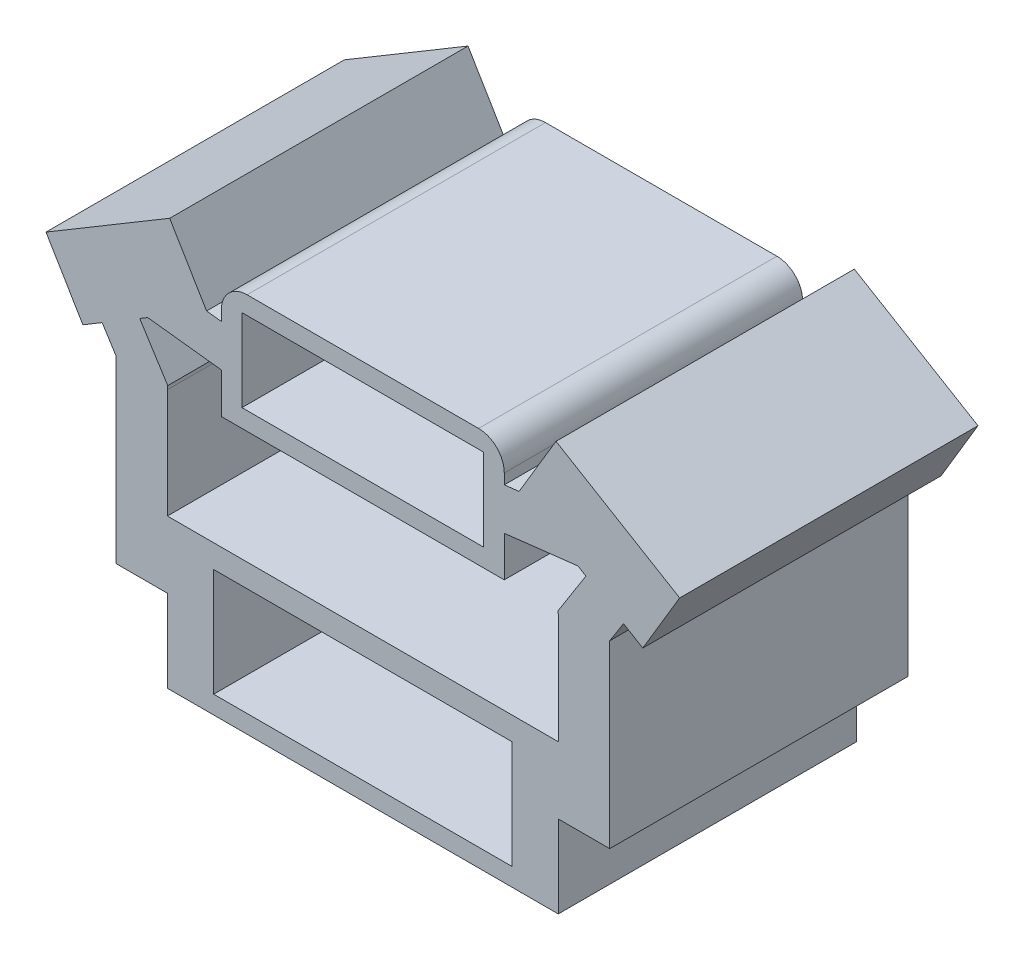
ISO-10303-21;
HEADER;
FILE_DESCRIPTION(('STEP AP214'),'2;1');
FILE_NAME('part.step','',(''),(''),'','','');
FILE_SCHEMA(('AUTOMOTIVE_DESIGN { 1 0 10303 214 1 1 1 1 }'));
ENDSEC;
DATA;
#1=APPLICATION_CONTEXT('core data for automotive mechanical design processes');
#2=APPLICATION_PROTOCOL_DEFINITION('international standard','automotive_design',2000,#1);
#3=PRODUCT_CONTEXT('',#1,'mechanical');
#4=PRODUCT('Part','Part','',(#3));
#5=PRODUCT_RELATED_PRODUCT_CATEGORY('part','',(#4));
#6=PRODUCT_DEFINITION_FORMATION('','',#4);
#7=PRODUCT_DEFINITION_CONTEXT('part definition',#1,'design');
#8=PRODUCT_DEFINITION('design','',#6,#7);
#9=PRODUCT_DEFINITION_SHAPE('','',#8);
#10=(LENGTH_UNIT() NAMED_UNIT(*) SI_UNIT(.MILLI.,.METRE.));
#11=(NAMED_UNIT(*) PLANE_ANGLE_UNIT() SI_UNIT($,.RADIAN.));
#12=(NAMED_UNIT(*) SI_UNIT($,.STERADIAN.) SOLID_ANGLE_UNIT());
#13=UNCERTAINTY_MEASURE_WITH_UNIT(LENGTH_MEASURE(1.E-05),#10,'distance_accuracy_value','');
#14=(GEOMETRIC_REPRESENTATION_CONTEXT(3) GLOBAL_UNCERTAINTY_ASSIGNED_CONTEXT((#13)) GLOBAL_UNIT_ASSIGNED_CONTEXT((#10,
#11,#12)) REPRESENTATION_CONTEXT('',''));
#15=CARTESIAN_POINT('',(0.,0.,0.));
#16=DIRECTION('',(0.,0.,1.));
#17=DIRECTION('',(1.,0.,0.));
#18=AXIS2_PLACEMENT_3D('',#15,#16,#17);
#19=CARTESIAN_POINT('',(3.8,1.4,5.8));
#20=DIRECTION('',(1.,0.,0.));
#21=DIRECTION('',(0.,0.,-1.));
#22=AXIS2_PLACEMENT_3D('',#19,#20,#21);
#23=PLANE('',#22);
#24=DIRECTION('',(0.,-1.,0.));
#25=VECTOR('',#24,1.);
#26=CARTESIAN_POINT('',(3.8,1.4,5.8));
#27=LINE('',#26,#25);
#28=CARTESIAN_POINT('',(3.8,3.52699893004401,5.8));
#29=VERTEX_POINT('',#28);
#30=CARTESIAN_POINT('',(3.8,1.4,5.8));
#31=VERTEX_POINT('',#30);
#32=EDGE_CURVE('E525',#29,#31,#27,.T.);
#33=ORIENTED_EDGE('',*,*,#32,.F.);
#34=DIRECTION('',(0.,0.,-1.));
#35=VECTOR('',#34,1.);
#36=CARTESIAN_POINT('',(3.8,3.52699893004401,5.8));
#37=LINE('',#36,#35);
#38=CARTESIAN_POINT('',(3.8,3.52699893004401,0.));
#39=VERTEX_POINT('',#38);
#40=EDGE_CURVE('E675',#29,#39,#37,.T.);
#41=ORIENTED_EDGE('',*,*,#40,.T.);
#42=DIRECTION('',(0.,-1.,0.));
#43=VECTOR('',#42,1.);
#44=CARTESIAN_POINT('',(3.8,1.4,0.));
#45=LINE('',#44,#43);
#46=CARTESIAN_POINT('',(3.8,1.4,0.));
#47=VERTEX_POINT('',#46);
#48=EDGE_CURVE('E524',#39,#47,#45,.T.);
#49=ORIENTED_EDGE('',*,*,#48,.T.);
#50=DIRECTION('',(0.,0.,-1.));
#51=VECTOR('',#50,1.);
#52=CARTESIAN_POINT('',(3.8,1.4,5.8));
#53=LINE('',#52,#51);
#54=EDGE_CURVE('E649',#31,#47,#53,.T.);
#55=ORIENTED_EDGE('',*,*,#54,.F.);
#56=EDGE_LOOP('',(#33,#41,#49,#55));
#57=FACE_BOUND('',#56,.T.);
#58=ADVANCED_FACE('F35',(#57),#23,.F.);
#59=CARTESIAN_POINT('',(-3.8,1.4,5.8));
#60=DIRECTION('',(0.,-1.,0.));
#61=DIRECTION('',(1.,0.,0.));
#62=AXIS2_PLACEMENT_3D('',#59,#60,#61);
#63=PLANE('',#62);
#64=DIRECTION('',(-1.,0.,0.));
#65=VECTOR('',#64,1.);
#66=CARTESIAN_POINT('',(-3.8,1.4,0.));
#67=LINE('',#66,#65);
#68=CARTESIAN_POINT('',(-3.8,1.4,0.));
#69=VERTEX_POINT('',#68);
#70=EDGE_CURVE('E565',#47,#69,#67,.T.);
#71=ORIENTED_EDGE('',*,*,#70,.T.);
#72=DIRECTION('',(0.,0.,-1.));
#73=VECTOR('',#72,1.);
#74=CARTESIAN_POINT('',(-3.8,1.4,5.8));
#75=LINE('',#74,#73);
#76=CARTESIAN_POINT('',(-3.8,1.4,5.8));
#77=VERTEX_POINT('',#76);
#78=EDGE_CURVE('E646',#77,#69,#75,.T.);
#79=ORIENTED_EDGE('',*,*,#78,.F.);
#80=DIRECTION('',(-1.,0.,0.));
#81=VECTOR('',#80,1.);
#82=CARTESIAN_POINT('',(-3.8,1.4,5.8));
#83=LINE('',#82,#81);
#84=EDGE_CURVE('E527',#31,#77,#83,.T.);
#85=ORIENTED_EDGE('',*,*,#84,.F.);
#86=ORIENTED_EDGE('',*,*,#54,.T.);
#87=EDGE_LOOP('',(#71,#79,#85,#86));
#88=FACE_BOUND('',#87,.T.);
#89=ADVANCED_FACE('F698',(#88),#63,.F.);
#90=CARTESIAN_POINT('',(-3.8,-1.4,5.8));
#91=DIRECTION('',(1.,0.,0.));
#92=DIRECTION('',(0.,0.,-1.));
#93=AXIS2_PLACEMENT_3D('',#90,#91,#92);
#94=PLANE('',#93);
#95=DIRECTION('',(0.,-1.,0.));
#96=VECTOR('',#95,1.);
#97=CARTESIAN_POINT('',(-3.8,-1.4,5.8));
#98=LINE('',#97,#96);
#99=CARTESIAN_POINT('',(-3.8,0.1,5.8));
#100=VERTEX_POINT('',#99);
#101=CARTESIAN_POINT('',(-3.8,-1.5,5.8));
#102=VERTEX_POINT('',#101);
#103=EDGE_CURVE('E531',#100,#102,#98,.T.);
#104=ORIENTED_EDGE('',*,*,#103,.F.);
#105=DIRECTION('',(0.,0.,-1.));
#106=VECTOR('',#105,1.);
#107=CARTESIAN_POINT('',(-3.8,0.1,5.8));
#108=LINE('',#107,#106);
#109=CARTESIAN_POINT('',(-3.8,0.1,0.));
#110=VERTEX_POINT('',#109);
#111=EDGE_CURVE('E464',#100,#110,#108,.T.);
#112=ORIENTED_EDGE('',*,*,#111,.T.);
#113=DIRECTION('',(0.,-1.,0.));
#114=VECTOR('',#113,1.);
#115=CARTESIAN_POINT('',(-3.8,-1.4,0.));
#116=LINE('',#115,#114);
#117=CARTESIAN_POINT('',(-3.8,-1.5,0.));
#118=VERTEX_POINT('',#117);
#119=EDGE_CURVE('E568',#110,#118,#116,.T.);
#120=ORIENTED_EDGE('',*,*,#119,.T.);
#121=DIRECTION('',(0.,0.,1.));
#122=VECTOR('',#121,1.);
#123=CARTESIAN_POINT('',(-3.8,-1.5,-7.60065786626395));
#124=LINE('',#123,#122);
#125=EDGE_CURVE('E361',#118,#102,#124,.T.);
#126=ORIENTED_EDGE('',*,*,#125,.T.);
#127=EDGE_LOOP('',(#104,#112,#120,#126));
#128=FACE_BOUND('',#127,.T.);
#129=ADVANCED_FACE('F753',(#128),#94,.F.);
#130=CARTESIAN_POINT('',(3.8,-1.4,5.8));
#131=DIRECTION('',(-1.,0.,0.));
#132=DIRECTION('',(0.,0.,1.));
#133=AXIS2_PLACEMENT_3D('',#130,#131,#132);
#134=PLANE('',#133);
#135=DIRECTION('',(0.,1.,0.));
#136=VECTOR('',#135,1.);
#137=CARTESIAN_POINT('',(3.8,-1.4,0.));
#138=LINE('',#137,#136);
#139=CARTESIAN_POINT('',(3.8,-1.5,0.));
#140=VERTEX_POINT('',#139);
#141=CARTESIAN_POINT('',(3.8,0.1,0.));
#142=VERTEX_POINT('',#141);
#143=EDGE_CURVE('E570',#140,#142,#138,.T.);
#144=ORIENTED_EDGE('',*,*,#143,.T.);
#145=DIRECTION('',(0.,0.,-1.));
#146=VECTOR('',#145,1.);
#147=CARTESIAN_POINT('',(3.8,0.1,5.8));
#148=LINE('',#147,#146);
#149=CARTESIAN_POINT('',(3.8,0.1,5.8));
#150=VERTEX_POINT('',#149);
#151=EDGE_CURVE('E643',#150,#142,#148,.T.);
#152=ORIENTED_EDGE('',*,*,#151,.F.);
#153=DIRECTION('',(0.,1.,0.));
#154=VECTOR('',#153,1.);
#155=CARTESIAN_POINT('',(3.8,-1.4,5.8));
#156=LINE('',#155,#154);
#157=CARTESIAN_POINT('',(3.8,-1.5,5.8));
#158=VERTEX_POINT('',#157);
#159=EDGE_CURVE('E533',#158,#150,#156,.T.);
#160=ORIENTED_EDGE('',*,*,#159,.F.);
#161=DIRECTION('',(0.,0.,1.));
#162=VECTOR('',#161,1.);
#163=CARTESIAN_POINT('',(3.8,-1.5,-7.60065786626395));
#164=LINE('',#163,#162);
#165=EDGE_CURVE('E362',#140,#158,#164,.T.);
#166=ORIENTED_EDGE('',*,*,#165,.F.);
#167=EDGE_LOOP('',(#144,#152,#160,#166));
#168=FACE_BOUND('',#167,.T.);
#169=ADVANCED_FACE('F1061',(#168),#134,.F.);
#170=CARTESIAN_POINT('',(3.8,0.1,5.8));
#171=DIRECTION('',(0.,1.,0.));
#172=DIRECTION('',(0.,0.,1.));
#173=AXIS2_PLACEMENT_3D('',#170,#171,#172);
#174=PLANE('',#173);
#175=DIRECTION('',(1.,0.,0.));
#176=VECTOR('',#175,1.);
#177=CARTESIAN_POINT('',(3.8,0.1,0.));
#178=LINE('',#177,#176);
#179=CARTESIAN_POINT('',(4.8,0.1,0.));
#180=VERTEX_POINT('',#179);
#181=EDGE_CURVE('E572',#142,#180,#178,.T.);
#182=ORIENTED_EDGE('',*,*,#181,.T.);
#183=DIRECTION('',(0.,0.,-1.));
#184=VECTOR('',#183,1.);
#185=CARTESIAN_POINT('',(4.8,0.1,5.8));
#186=LINE('',#185,#184);
#187=CARTESIAN_POINT('',(4.8,0.1,5.8));
#188=VERTEX_POINT('',#187);
#189=EDGE_CURVE('E640',#188,#180,#186,.T.);
#190=ORIENTED_EDGE('',*,*,#189,.F.);
#191=DIRECTION('',(1.,0.,0.));
#192=VECTOR('',#191,1.);
#193=CARTESIAN_POINT('',(3.8,0.1,5.8));
#194=LINE('',#193,#192);
#195=EDGE_CURVE('E535',#150,#188,#194,.T.);
#196=ORIENTED_EDGE('',*,*,#195,.F.);
#197=ORIENTED_EDGE('',*,*,#151,.T.);
#198=EDGE_LOOP('',(#182,#190,#196,#197));
#199=FACE_BOUND('',#198,.T.);
#200=ADVANCED_FACE('F1070',(#199),#174,.F.);
#201=CARTESIAN_POINT('',(4.8,3.6,5.8));
#202=DIRECTION('',(-1.,0.,0.));
#203=DIRECTION('',(0.,-1.,0.));
#204=AXIS2_PLACEMENT_3D('',#201,#202,#203);
#205=PLANE('',#204);
#206=DIRECTION('',(0.,1.,0.));
#207=VECTOR('',#206,1.);
#208=CARTESIAN_POINT('',(4.8,3.6,0.));
#209=LINE('',#208,#207);
#210=CARTESIAN_POINT('',(4.8,3.6,0.));
#211=VERTEX_POINT('',#210);
#212=EDGE_CURVE('E574',#180,#211,#209,.T.);
#213=ORIENTED_EDGE('',*,*,#212,.T.);
#214=DIRECTION('',(0.,0.,-1.));
#215=VECTOR('',#214,1.);
#216=CARTESIAN_POINT('',(4.8,3.6,5.8));
#217=LINE('',#216,#215);
#218=CARTESIAN_POINT('',(4.8,3.6,5.8));
#219=VERTEX_POINT('',#218);
#220=EDGE_CURVE('E637',#219,#211,#217,.T.);
#221=ORIENTED_EDGE('',*,*,#220,.F.);
#222=DIRECTION('',(0.,1.,0.));
#223=VECTOR('',#222,1.);
#224=CARTESIAN_POINT('',(4.8,3.6,5.8));
#225=LINE('',#224,#223);
#226=EDGE_CURVE('E537',#188,#219,#225,.T.);
#227=ORIENTED_EDGE('',*,*,#226,.F.);
#228=ORIENTED_EDGE('',*,*,#189,.T.);
#229=EDGE_LOOP('',(#213,#221,#227,#228));
#230=FACE_BOUND('',#229,.T.);
#231=ADVANCED_FACE('F1083',(#230),#205,.F.);
#232=CARTESIAN_POINT('',(4.8,3.6,5.8));
#233=DIRECTION('',(-0.844327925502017,0.535826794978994,0.));
#234=DIRECTION('',(-0.535826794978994,-0.844327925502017,0.));
#235=AXIS2_PLACEMENT_3D('',#232,#233,#234);
#236=PLANE('',#235);
#237=DIRECTION('',(0.535826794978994,0.844327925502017,0.));
#238=VECTOR('',#237,1.);
#239=CARTESIAN_POINT('',(4.8,3.6,0.));
#240=LINE('',#239,#238);
#241=CARTESIAN_POINT('',(5.0679133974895,4.02216396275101,0.));
#242=VERTEX_POINT('',#241);
#243=EDGE_CURVE('E576',#211,#242,#240,.T.);
#244=ORIENTED_EDGE('',*,*,#243,.T.);
#245=DIRECTION('',(0.,0.,-1.));
#246=VECTOR('',#245,1.);
#247=CARTESIAN_POINT('',(5.0679133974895,4.02216396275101,5.8));
#248=LINE('',#247,#246);
#249=CARTESIAN_POINT('',(5.0679133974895,4.02216396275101,5.8));
#250=VERTEX_POINT('',#249);
#251=EDGE_CURVE('E634',#250,#242,#248,.T.);
#252=ORIENTED_EDGE('',*,*,#251,.F.);
#253=DIRECTION('',(0.535826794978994,0.844327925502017,0.));
#254=VECTOR('',#253,1.);
#255=CARTESIAN_POINT('',(4.8,3.6,5.8));
#256=LINE('',#255,#254);
#257=EDGE_CURVE('E539',#219,#250,#256,.T.);
#258=ORIENTED_EDGE('',*,*,#257,.F.);
#259=ORIENTED_EDGE('',*,*,#220,.T.);
#260=EDGE_LOOP('',(#244,#252,#258,#259));
#261=FACE_BOUND('',#260,.T.);
#262=ADVANCED_FACE('F1090',(#261),#236,.F.);
#263=CARTESIAN_POINT('',(5.0679133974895,4.02216396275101,5.8));
#264=DIRECTION('',(0.512399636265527,0.85874711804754,0.));
#265=DIRECTION('',(-0.85874711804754,0.512399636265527,0.));
#266=AXIS2_PLACEMENT_3D('',#263,#264,#265);
#267=PLANE('',#266);
#268=DIRECTION('',(0.85874711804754,-0.512399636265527,0.));
#269=VECTOR('',#268,1.);
#270=CARTESIAN_POINT('',(5.0679133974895,4.02216396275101,0.));
#271=LINE('',#270,#269);
#272=CARTESIAN_POINT('',(5.44257003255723,3.79861279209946,0.));
#273=VERTEX_POINT('',#272);
#274=EDGE_CURVE('E578',#242,#273,#271,.T.);
#275=ORIENTED_EDGE('',*,*,#274,.T.);
#276=DIRECTION('',(0.,0.,-1.));
#277=VECTOR('',#276,1.);
#278=CARTESIAN_POINT('',(5.44257003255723,3.79861279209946,5.8));
#279=LINE('',#278,#277);
#280=CARTESIAN_POINT('',(5.44257003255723,3.79861279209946,5.8));
#281=VERTEX_POINT('',#280);
#282=EDGE_CURVE('E631',#281,#273,#279,.T.);
#283=ORIENTED_EDGE('',*,*,#282,.F.);
#284=DIRECTION('',(0.85874711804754,-0.512399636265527,0.));
#285=VECTOR('',#284,1.);
#286=CARTESIAN_POINT('',(5.0679133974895,4.02216396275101,5.8));
#287=LINE('',#286,#285);
#288=EDGE_CURVE('E541',#250,#281,#287,.T.);
#289=ORIENTED_EDGE('',*,*,#288,.F.);
#290=ORIENTED_EDGE('',*,*,#251,.T.);
#291=EDGE_LOOP('',(#275,#283,#289,#290));
#292=FACE_BOUND('',#291,.T.);
#293=ADVANCED_FACE('F1098',(#292),#267,.F.);
#294=CARTESIAN_POINT('',(5.44257003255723,3.79861279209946,5.8));
#295=DIRECTION('',(-0.85874711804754,0.512399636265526,0.));
#296=DIRECTION('',(-0.512399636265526,-0.85874711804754,0.));
#297=AXIS2_PLACEMENT_3D('',#294,#295,#296);
#298=PLANE('',#297);
#299=DIRECTION('',(0.512399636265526,0.85874711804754,0.));
#300=VECTOR('',#299,1.);
#301=CARTESIAN_POINT('',(5.44257003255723,3.79861279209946,0.));
#302=LINE('',#301,#300);
#303=CARTESIAN_POINT('',(6.15992952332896,5.00085875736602,0.));
#304=VERTEX_POINT('',#303);
#305=EDGE_CURVE('E580',#273,#304,#302,.T.);
#306=ORIENTED_EDGE('',*,*,#305,.T.);
#307=DIRECTION('',(0.,0.,-1.));
#308=VECTOR('',#307,1.);
#309=CARTESIAN_POINT('',(6.15992952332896,5.00085875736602,5.8));
#310=LINE('',#309,#308);
#311=CARTESIAN_POINT('',(6.15992952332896,5.00085875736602,5.8));
#312=VERTEX_POINT('',#311);
#313=EDGE_CURVE('E628',#312,#304,#310,.T.);
#314=ORIENTED_EDGE('',*,*,#313,.F.);
#315=DIRECTION('',(0.512399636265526,0.85874711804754,0.));
#316=VECTOR('',#315,1.);
#317=CARTESIAN_POINT('',(5.44257003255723,3.79861279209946,5.8));
#318=LINE('',#317,#316);
#319=EDGE_CURVE('E543',#281,#312,#318,.T.);
#320=ORIENTED_EDGE('',*,*,#319,.F.);
#321=ORIENTED_EDGE('',*,*,#282,.T.);
#322=EDGE_LOOP('',(#306,#314,#320,#321));
#323=FACE_BOUND('',#322,.T.);
#324=ADVANCED_FACE('F1106',(#323),#298,.F.);
#325=CARTESIAN_POINT('',(3.75543759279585,6.43557773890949,5.8));
#326=DIRECTION('',(-0.512399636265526,-0.85874711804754,0.));
#327=DIRECTION('',(0.85874711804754,-0.512399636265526,0.));
#328=AXIS2_PLACEMENT_3D('',#325,#326,#327);
#329=PLANE('',#328);
#330=DIRECTION('',(-0.85874711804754,0.512399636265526,0.));
#331=VECTOR('',#330,1.);
#332=CARTESIAN_POINT('',(3.75543759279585,6.43557773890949,0.));
#333=LINE('',#332,#331);
#334=CARTESIAN_POINT('',(3.75543759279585,6.43557773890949,0.));
#335=VERTEX_POINT('',#334);
#336=EDGE_CURVE('E582',#304,#335,#333,.T.);
#337=ORIENTED_EDGE('',*,*,#336,.T.);
#338=DIRECTION('',(0.,0.,-1.));
#339=VECTOR('',#338,1.);
#340=CARTESIAN_POINT('',(3.75543759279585,6.43557773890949,5.8));
#341=LINE('',#340,#339);
#342=CARTESIAN_POINT('',(3.75543759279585,6.43557773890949,5.8));
#343=VERTEX_POINT('',#342);
#344=EDGE_CURVE('E625',#343,#335,#341,.T.);
#345=ORIENTED_EDGE('',*,*,#344,.F.);
#346=DIRECTION('',(-0.85874711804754,0.512399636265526,0.));
#347=VECTOR('',#346,1.);
#348=CARTESIAN_POINT('',(3.75543759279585,6.43557773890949,5.8));
#349=LINE('',#348,#347);
#350=EDGE_CURVE('E545',#312,#343,#349,.T.);
#351=ORIENTED_EDGE('',*,*,#350,.F.);
#352=ORIENTED_EDGE('',*,*,#313,.T.);
#353=EDGE_LOOP('',(#337,#345,#351,#352));
#354=FACE_BOUND('',#353,.T.);
#355=ADVANCED_FACE('F1114',(#354),#329,.F.);
#356=CARTESIAN_POINT('',(3.75543759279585,6.43557773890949,5.8));
#357=DIRECTION('',(0.858747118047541,-0.512399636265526,0.));
#358=DIRECTION('',(0.512399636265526,0.858747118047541,0.));
#359=AXIS2_PLACEMENT_3D('',#356,#357,#358);
#360=PLANE('',#359);
#361=DIRECTION('',(-0.512399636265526,-0.858747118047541,0.));
#362=VECTOR('',#361,1.);
#363=CARTESIAN_POINT('',(3.75543759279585,6.43557773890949,0.));
#364=LINE('',#363,#362);
#365=CARTESIAN_POINT('',(3.03807810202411,5.23333177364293,0.));
#366=VERTEX_POINT('',#365);
#367=EDGE_CURVE('E584',#335,#366,#364,.T.);
#368=ORIENTED_EDGE('',*,*,#367,.T.);
#369=DIRECTION('',(0.,0.,-1.));
#370=VECTOR('',#369,1.);
#371=CARTESIAN_POINT('',(3.03807810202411,5.23333177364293,5.8));
#372=LINE('',#371,#370);
#373=CARTESIAN_POINT('',(3.03807810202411,5.23333177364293,5.8));
#374=VERTEX_POINT('',#373);
#375=EDGE_CURVE('E622',#374,#366,#372,.T.);
#376=ORIENTED_EDGE('',*,*,#375,.F.);
#377=DIRECTION('',(-0.512399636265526,-0.858747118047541,0.));
#378=VECTOR('',#377,1.);
#379=CARTESIAN_POINT('',(3.75543759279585,6.43557773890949,5.8));
#380=LINE('',#379,#378);
#381=EDGE_CURVE('E547',#343,#374,#380,.T.);
#382=ORIENTED_EDGE('',*,*,#381,.F.);
#383=ORIENTED_EDGE('',*,*,#344,.T.);
#384=EDGE_LOOP('',(#368,#376,#382,#383));
#385=FACE_BOUND('',#384,.T.);
#386=ADVANCED_FACE('F1122',(#385),#360,.F.);
#387=CARTESIAN_POINT('',(2.75,5.2,5.8));
#388=DIRECTION('',(0.114937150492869,-0.993372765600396,0.));
#389=DIRECTION('',(0.993372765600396,0.114937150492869,0.));
#390=AXIS2_PLACEMENT_3D('',#387,#388,#389);
#391=PLANE('',#390);
#392=DIRECTION('',(-0.993372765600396,-0.114937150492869,0.));
#393=VECTOR('',#392,1.);
#394=CARTESIAN_POINT('',(2.75,5.2,0.));
#395=LINE('',#394,#393);
#396=CARTESIAN_POINT('',(2.75,5.2,0.));
#397=VERTEX_POINT('',#396);
#398=EDGE_CURVE('E586',#366,#397,#395,.T.);
#399=ORIENTED_EDGE('',*,*,#398,.T.);
#400=DIRECTION('',(0.,0.,-1.));
#401=VECTOR('',#400,1.);
#402=CARTESIAN_POINT('',(2.75,5.2,5.8));
#403=LINE('',#402,#401);
#404=CARTESIAN_POINT('',(2.75,5.2,5.8));
#405=VERTEX_POINT('',#404);
#406=EDGE_CURVE('E619',#405,#397,#403,.T.);
#407=ORIENTED_EDGE('',*,*,#406,.F.);
#408=DIRECTION('',(-0.993372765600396,-0.114937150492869,0.));
#409=VECTOR('',#408,1.);
#410=CARTESIAN_POINT('',(2.75,5.2,5.8));
#411=LINE('',#410,#409);
#412=EDGE_CURVE('E549',#374,#405,#411,.T.);
#413=ORIENTED_EDGE('',*,*,#412,.F.);
#414=ORIENTED_EDGE('',*,*,#375,.T.);
#415=EDGE_LOOP('',(#399,#407,#413,#414));
#416=FACE_BOUND('',#415,.T.);
#417=ADVANCED_FACE('F1130',(#416),#391,.F.);
#418=CARTESIAN_POINT('',(-2.75,5.2,5.8));
#419=DIRECTION('',(1.,0.,0.));
#420=DIRECTION('',(0.,0.,-1.));
#421=AXIS2_PLACEMENT_3D('',#418,#419,#420);
#422=PLANE('',#421);
#423=DIRECTION('',(0.,-1.,0.));
#424=VECTOR('',#423,1.);
#425=CARTESIAN_POINT('',(-2.75,5.2,5.8));
#426=LINE('',#425,#424);
#427=CARTESIAN_POINT('',(-2.75,4.38459612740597,5.8));
#428=VERTEX_POINT('',#427);
#429=CARTESIAN_POINT('',(-2.75,3.6,5.8));
#430=VERTEX_POINT('',#429);
#431=EDGE_CURVE('E551',#428,#430,#426,.T.);
#432=ORIENTED_EDGE('',*,*,#431,.F.);
#433=DIRECTION('',(0.,0.,-1.));
#434=VECTOR('',#433,1.);
#435=CARTESIAN_POINT('',(-2.75,4.38459612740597,5.8));
#436=LINE('',#435,#434);
#437=CARTESIAN_POINT('',(-2.75,4.38459612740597,0.));
#438=VERTEX_POINT('',#437);
#439=EDGE_CURVE('E514',#428,#438,#436,.T.);
#440=ORIENTED_EDGE('',*,*,#439,.T.);
#441=DIRECTION('',(0.,-1.,0.));
#442=VECTOR('',#441,1.);
#443=CARTESIAN_POINT('',(-2.75,5.2,0.));
#444=LINE('',#443,#442);
#445=CARTESIAN_POINT('',(-2.75,3.6,0.));
#446=VERTEX_POINT('',#445);
#447=EDGE_CURVE('E589',#438,#446,#444,.T.);
#448=ORIENTED_EDGE('',*,*,#447,.T.);
#449=DIRECTION('',(0.,0.,-1.));
#450=VECTOR('',#449,1.);
#451=CARTESIAN_POINT('',(-2.75,3.6,5.8));
#452=LINE('',#451,#450);
#453=EDGE_CURVE('E614',#430,#446,#452,.T.);
#454=ORIENTED_EDGE('',*,*,#453,.F.);
#455=EDGE_LOOP('',(#432,#440,#448,#454));
#456=FACE_BOUND('',#455,.T.);
#457=ADVANCED_FACE('F721',(#456),#422,.F.);
#458=CARTESIAN_POINT('',(-2.75,3.6,5.8));
#459=DIRECTION('',(0.,1.,0.));
#460=DIRECTION('',(0.,0.,1.));
#461=AXIS2_PLACEMENT_3D('',#458,#459,#460);
#462=PLANE('',#461);
#463=DIRECTION('',(1.,0.,0.));
#464=VECTOR('',#463,1.);
#465=CARTESIAN_POINT('',(-2.75,3.6,0.));
#466=LINE('',#465,#464);
#467=CARTESIAN_POINT('',(2.75,3.6,0.));
#468=VERTEX_POINT('',#467);
#469=EDGE_CURVE('E591',#446,#468,#466,.T.);
#470=ORIENTED_EDGE('',*,*,#469,.T.);
#471=DIRECTION('',(0.,0.,-1.));
#472=VECTOR('',#471,1.);
#473=CARTESIAN_POINT('',(2.75,3.6,5.8));
#474=LINE('',#473,#472);
#475=CARTESIAN_POINT('',(2.75,3.6,5.8));
#476=VERTEX_POINT('',#475);
#477=EDGE_CURVE('E611',#476,#468,#474,.T.);
#478=ORIENTED_EDGE('',*,*,#477,.F.);
#479=DIRECTION('',(1.,0.,0.));
#480=VECTOR('',#479,1.);
#481=CARTESIAN_POINT('',(-2.75,3.6,5.8));
#482=LINE('',#481,#480);
#483=EDGE_CURVE('E553',#430,#476,#482,.T.);
#484=ORIENTED_EDGE('',*,*,#483,.F.);
#485=ORIENTED_EDGE('',*,*,#453,.T.);
#486=EDGE_LOOP('',(#470,#478,#484,#485));
#487=FACE_BOUND('',#486,.T.);
#488=ADVANCED_FACE('F728',(#487),#462,.F.);
#489=CARTESIAN_POINT('',(2.75,4.38459612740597,5.8));
#490=DIRECTION('',(-1.,0.,0.));
#491=DIRECTION('',(0.,0.,1.));
#492=AXIS2_PLACEMENT_3D('',#489,#490,#491);
#493=PLANE('',#492);
#494=DIRECTION('',(0.,1.,0.));
#495=VECTOR('',#494,1.);
#496=CARTESIAN_POINT('',(2.75,4.38459612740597,0.));
#497=LINE('',#496,#495);
#498=CARTESIAN_POINT('',(2.75,4.38459612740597,0.));
#499=VERTEX_POINT('',#498);
#500=EDGE_CURVE('E593',#468,#499,#497,.T.);
#501=ORIENTED_EDGE('',*,*,#500,.T.);
#502=DIRECTION('',(0.,0.,-1.));
#503=VECTOR('',#502,1.);
#504=CARTESIAN_POINT('',(2.75,4.38459612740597,5.8));
#505=LINE('',#504,#503);
#506=CARTESIAN_POINT('',(2.75,4.38459612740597,5.8));
#507=VERTEX_POINT('',#506);
#508=EDGE_CURVE('E608',#507,#499,#505,.T.);
#509=ORIENTED_EDGE('',*,*,#508,.F.);
#510=DIRECTION('',(0.,1.,0.));
#511=VECTOR('',#510,1.);
#512=CARTESIAN_POINT('',(2.75,4.38459612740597,5.8));
#513=LINE('',#512,#511);
#514=EDGE_CURVE('E555',#476,#507,#513,.T.);
#515=ORIENTED_EDGE('',*,*,#514,.F.);
#516=ORIENTED_EDGE('',*,*,#477,.T.);
#517=EDGE_LOOP('',(#501,#509,#515,#516));
#518=FACE_BOUND('',#517,.T.);
#519=ADVANCED_FACE('F732',(#518),#493,.F.);
#520=CARTESIAN_POINT('',(2.75,4.38459612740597,5.8));
#521=DIRECTION('',(-0.114937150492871,0.993372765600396,0.));
#522=DIRECTION('',(-0.993372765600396,-0.114937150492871,0.));
#523=AXIS2_PLACEMENT_3D('',#520,#521,#522);
#524=PLANE('',#523);
#525=DIRECTION('',(0.993372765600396,0.114937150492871,0.));
#526=VECTOR('',#525,1.);
#527=CARTESIAN_POINT('',(2.75,4.38459612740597,0.));
#528=LINE('',#527,#526);
#529=CARTESIAN_POINT('',(4.18268652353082,4.55036361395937,0.));
#530=VERTEX_POINT('',#529);
#531=EDGE_CURVE('E595',#499,#530,#528,.T.);
#532=ORIENTED_EDGE('',*,*,#531,.T.);
#533=DIRECTION('',(0.,0.,-1.));
#534=VECTOR('',#533,1.);
#535=CARTESIAN_POINT('',(4.18268652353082,4.55036361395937,5.8));
#536=LINE('',#535,#534);
#537=CARTESIAN_POINT('',(4.18268652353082,4.55036361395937,5.8));
#538=VERTEX_POINT('',#537);
#539=EDGE_CURVE('E605',#538,#530,#536,.T.);
#540=ORIENTED_EDGE('',*,*,#539,.F.);
#541=DIRECTION('',(0.993372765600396,0.114937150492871,0.));
#542=VECTOR('',#541,1.);
#543=CARTESIAN_POINT('',(2.75,4.38459612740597,5.8));
#544=LINE('',#543,#542);
#545=EDGE_CURVE('E557',#507,#538,#544,.T.);
#546=ORIENTED_EDGE('',*,*,#545,.F.);
#547=ORIENTED_EDGE('',*,*,#508,.T.);
#548=EDGE_LOOP('',(#532,#540,#546,#547));
#549=FACE_BOUND('',#548,.T.);
#550=ADVANCED_FACE('F736',(#549),#524,.F.);
#551=CARTESIAN_POINT('',(4.18268652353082,4.55036361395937,5.8));
#552=DIRECTION('',(0.512399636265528,0.858747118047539,0.));
#553=DIRECTION('',(-0.85874711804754,0.512399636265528,0.));
#554=AXIS2_PLACEMENT_3D('',#551,#552,#553);
#555=PLANE('',#554);
#556=DIRECTION('',(0.85874711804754,-0.512399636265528,0.));
#557=VECTOR('',#556,1.);
#558=CARTESIAN_POINT('',(4.18268652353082,4.55036361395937,0.));
#559=LINE('',#558,#557);
#560=CARTESIAN_POINT('',(4.33770205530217,4.45786851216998,0.));
#561=VERTEX_POINT('',#560);
#562=EDGE_CURVE('E597',#530,#561,#559,.T.);
#563=ORIENTED_EDGE('',*,*,#562,.T.);
#564=DIRECTION('',(0.,0.,-1.));
#565=VECTOR('',#564,1.);
#566=CARTESIAN_POINT('',(4.33770205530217,4.45786851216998,5.8));
#567=LINE('',#566,#565);
#568=CARTESIAN_POINT('',(4.33770205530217,4.45786851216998,5.8));
#569=VERTEX_POINT('',#568);
#570=EDGE_CURVE('E602',#569,#561,#567,.T.);
#571=ORIENTED_EDGE('',*,*,#570,.F.);
#572=DIRECTION('',(0.85874711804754,-0.512399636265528,0.));
#573=VECTOR('',#572,1.);
#574=CARTESIAN_POINT('',(4.18268652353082,4.55036361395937,5.8));
#575=LINE('',#574,#573);
#576=EDGE_CURVE('E559',#538,#569,#575,.T.);
#577=ORIENTED_EDGE('',*,*,#576,.F.);
#578=ORIENTED_EDGE('',*,*,#539,.T.);
#579=EDGE_LOOP('',(#563,#571,#577,#578));
#580=FACE_BOUND('',#579,.T.);
#581=ADVANCED_FACE('F739',(#580),#555,.F.);
#582=CARTESIAN_POINT('',(3.79328214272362,3.6,5.8));
#583=DIRECTION('',(0.844327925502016,-0.535826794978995,0.));
#584=DIRECTION('',(0.535826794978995,0.844327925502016,0.));
#585=AXIS2_PLACEMENT_3D('',#582,#583,#584);
#586=PLANE('',#585);
#587=DIRECTION('',(-0.535826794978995,-0.844327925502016,0.));
#588=VECTOR('',#587,1.);
#589=CARTESIAN_POINT('',(3.79328214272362,3.6,0.));
#590=LINE('',#589,#588);
#591=CARTESIAN_POINT('',(3.79328214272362,3.6,0.));
#592=VERTEX_POINT('',#591);
#593=EDGE_CURVE('E528',#561,#592,#590,.T.);
#594=ORIENTED_EDGE('',*,*,#593,.T.);
#595=DIRECTION('',(0.,0.,-1.));
#596=VECTOR('',#595,1.);
#597=CARTESIAN_POINT('',(3.79328214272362,3.6,5.8));
#598=LINE('',#597,#596);
#599=CARTESIAN_POINT('',(3.79328214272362,3.6,5.8));
#600=VERTEX_POINT('',#599);
#601=EDGE_CURVE('E563',#600,#592,#598,.T.);
#602=ORIENTED_EDGE('',*,*,#601,.F.);
#603=DIRECTION('',(-0.535826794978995,-0.844327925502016,0.));
#604=VECTOR('',#603,1.);
#605=CARTESIAN_POINT('',(3.79328214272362,3.6,5.8));
#606=LINE('',#605,#604);
#607=EDGE_CURVE('E561',#569,#600,#606,.T.);
#608=ORIENTED_EDGE('',*,*,#607,.F.);
#609=ORIENTED_EDGE('',*,*,#570,.T.);
#610=EDGE_LOOP('',(#594,#602,#608,#609));
#611=FACE_BOUND('',#610,.T.);
#612=ADVANCED_FACE('F688',(#611),#586,.F.);
#613=CARTESIAN_POINT('',(0.,0.,5.8));
#614=DIRECTION('',(0.,0.,1.));
#615=DIRECTION('',(1.,0.,0.));
#616=AXIS2_PLACEMENT_3D('',#613,#614,#615);
#617=PLANE('',#616);
#618=DIRECTION('',(1.,0.,0.));
#619=VECTOR('',#618,1.);
#620=CARTESIAN_POINT('',(-2.9,-1.15,5.8));
#621=LINE('',#620,#619);
#622=CARTESIAN_POINT('',(-2.9,-1.15,5.8));
#623=VERTEX_POINT('',#622);
#624=CARTESIAN_POINT('',(2.9,-1.15,5.8));
#625=VERTEX_POINT('',#624);
#626=EDGE_CURVE('E353',#623,#625,#621,.T.);
#627=ORIENTED_EDGE('',*,*,#626,.F.);
#628=DIRECTION('',(0.,-1.,0.));
#629=VECTOR('',#628,1.);
#630=CARTESIAN_POINT('',(-2.9,-1.05,5.8));
#631=LINE('',#630,#629);
#632=CARTESIAN_POINT('',(-2.9,0.95,5.8));
#633=VERTEX_POINT('',#632);
#634=EDGE_CURVE('E344',#633,#623,#631,.T.);
#635=ORIENTED_EDGE('',*,*,#634,.F.);
#636=DIRECTION('',(1.,0.,0.));
#637=VECTOR('',#636,1.);
#638=CARTESIAN_POINT('',(-2.9,0.95,5.8));
#639=LINE('',#638,#637);
#640=CARTESIAN_POINT('',(2.9,0.95,5.8));
#641=VERTEX_POINT('',#640);
#642=EDGE_CURVE('E370',#633,#641,#639,.T.);
#643=ORIENTED_EDGE('',*,*,#642,.T.);
#644=DIRECTION('',(0.,1.,0.));
#645=VECTOR('',#644,1.);
#646=CARTESIAN_POINT('',(2.9,-1.05,5.8));
#647=LINE('',#646,#645);
#648=EDGE_CURVE('E408',#625,#641,#647,.T.);
#649=ORIENTED_EDGE('',*,*,#648,.F.);
#650=EDGE_LOOP('',(#627,#635,#643,#649));
#651=FACE_BOUND('',#650,.T.);
#652=DIRECTION('',(-1.,0.,0.));
#653=VECTOR('',#652,1.);
#654=CARTESIAN_POINT('',(-2.75,5.9,5.8));
#655=LINE('',#654,#653);
#656=CARTESIAN_POINT('',(2.25,5.9,5.8));
#657=VERTEX_POINT('',#656);
#658=CARTESIAN_POINT('',(-2.25,5.9,5.8));
#659=VERTEX_POINT('',#658);
#660=EDGE_CURVE('E394',#657,#659,#655,.T.);
#661=ORIENTED_EDGE('',*,*,#660,.T.);
#662=CARTESIAN_POINT('',(-2.25,5.4,5.8));
#663=DIRECTION('',(0.,0.,1.));
#664=DIRECTION('',(1.,0.,0.));
#665=AXIS2_PLACEMENT_3D('',#662,#663,#664);
#666=CIRCLE('',#665,0.5);
#667=CARTESIAN_POINT('',(-2.75,5.4,5.8));
#668=VERTEX_POINT('',#667);
#669=EDGE_CURVE('E662',#659,#668,#666,.T.);
#670=ORIENTED_EDGE('',*,*,#669,.T.);
#671=DIRECTION('',(0.,-1.,0.));
#672=VECTOR('',#671,1.);
#673=CARTESIAN_POINT('',(-2.75,5.2,5.8));
#674=LINE('',#673,#672);
#675=CARTESIAN_POINT('',(-2.75,5.2,5.8));
#676=VERTEX_POINT('',#675);
#677=EDGE_CURVE('E397',#668,#676,#674,.T.);
#678=ORIENTED_EDGE('',*,*,#677,.T.);
#679=DIRECTION('',(0.993372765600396,-0.114937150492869,0.));
#680=VECTOR('',#679,1.);
#681=CARTESIAN_POINT('',(-2.75,5.2,5.8));
#682=LINE('',#681,#680);
#683=CARTESIAN_POINT('',(-3.03807810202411,5.23333177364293,5.8));
#684=VERTEX_POINT('',#683);
#685=EDGE_CURVE('E440',#684,#676,#682,.T.);
#686=ORIENTED_EDGE('',*,*,#685,.F.);
#687=DIRECTION('',(0.512399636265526,-0.858747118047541,0.));
#688=VECTOR('',#687,1.);
#689=CARTESIAN_POINT('',(-3.75543759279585,6.43557773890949,5.8));
#690=LINE('',#689,#688);
#691=CARTESIAN_POINT('',(-3.75543759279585,6.43557773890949,5.8));
#692=VERTEX_POINT('',#691);
#693=EDGE_CURVE('E443',#692,#684,#690,.T.);
#694=ORIENTED_EDGE('',*,*,#693,.F.);
#695=DIRECTION('',(0.85874711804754,0.512399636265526,0.));
#696=VECTOR('',#695,1.);
#697=CARTESIAN_POINT('',(-3.75543759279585,6.43557773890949,5.8));
#698=LINE('',#697,#696);
#699=CARTESIAN_POINT('',(-6.15992952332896,5.00085875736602,5.8));
#700=VERTEX_POINT('',#699);
#701=EDGE_CURVE('E446',#700,#692,#698,.T.);
#702=ORIENTED_EDGE('',*,*,#701,.F.);
#703=DIRECTION('',(-0.512399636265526,0.85874711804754,0.));
#704=VECTOR('',#703,1.);
#705=CARTESIAN_POINT('',(-5.44257003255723,3.79861279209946,5.8));
#706=LINE('',#705,#704);
#707=CARTESIAN_POINT('',(-5.44257003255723,3.79861279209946,5.8));
#708=VERTEX_POINT('',#707);
#709=EDGE_CURVE('E449',#708,#700,#706,.T.);
#710=ORIENTED_EDGE('',*,*,#709,.F.);
#711=DIRECTION('',(-0.85874711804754,-0.512399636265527,0.));
#712=VECTOR('',#711,1.);
#713=CARTESIAN_POINT('',(-5.0679133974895,4.02216396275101,5.8));
#714=LINE('',#713,#712);
#715=CARTESIAN_POINT('',(-5.0679133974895,4.02216396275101,5.8));
#716=VERTEX_POINT('',#715);
#717=EDGE_CURVE('E452',#716,#708,#714,.T.);
#718=ORIENTED_EDGE('',*,*,#717,.F.);
#719=DIRECTION('',(-0.535826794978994,0.844327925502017,0.));
#720=VECTOR('',#719,1.);
#721=CARTESIAN_POINT('',(-4.8,3.6,5.8));
#722=LINE('',#721,#720);
#723=CARTESIAN_POINT('',(-4.8,3.6,5.8));
#724=VERTEX_POINT('',#723);
#725=EDGE_CURVE('E455',#724,#716,#722,.T.);
#726=ORIENTED_EDGE('',*,*,#725,.F.);
#727=DIRECTION('',(0.,1.,0.));
#728=VECTOR('',#727,1.);
#729=CARTESIAN_POINT('',(-4.8,3.6,5.8));
#730=LINE('',#729,#728);
#731=CARTESIAN_POINT('',(-4.8,0.1,5.8));
#732=VERTEX_POINT('',#731);
#733=EDGE_CURVE('E458',#732,#724,#730,.T.);
#734=ORIENTED_EDGE('',*,*,#733,.F.);
#735=DIRECTION('',(-1.,0.,0.));
#736=VECTOR('',#735,1.);
#737=CARTESIAN_POINT('',(-3.8,0.1,5.8));
#738=LINE('',#737,#736);
#739=EDGE_CURVE('E461',#100,#732,#738,.T.);
#740=ORIENTED_EDGE('',*,*,#739,.F.);
#741=ORIENTED_EDGE('',*,*,#103,.T.);
#742=DIRECTION('',(1.,0.,0.));
#743=VECTOR('',#742,1.);
#744=CARTESIAN_POINT('',(-3.8,-1.5,5.8));
#745=LINE('',#744,#743);
#746=EDGE_CURVE('E357',#102,#158,#745,.T.);
#747=ORIENTED_EDGE('',*,*,#746,.T.);
#748=ORIENTED_EDGE('',*,*,#159,.T.);
#749=ORIENTED_EDGE('',*,*,#195,.T.);
#750=ORIENTED_EDGE('',*,*,#226,.T.);
#751=ORIENTED_EDGE('',*,*,#257,.T.);
#752=ORIENTED_EDGE('',*,*,#288,.T.);
#753=ORIENTED_EDGE('',*,*,#319,.T.);
#754=ORIENTED_EDGE('',*,*,#350,.T.);
#755=ORIENTED_EDGE('',*,*,#381,.T.);
#756=ORIENTED_EDGE('',*,*,#412,.T.);
#757=DIRECTION('',(0.,1.,0.));
#758=VECTOR('',#757,1.);
#759=CARTESIAN_POINT('',(2.75,5.9,5.8));
#760=LINE('',#759,#758);
#761=CARTESIAN_POINT('',(2.75,5.4,5.8));
#762=VERTEX_POINT('',#761);
#763=EDGE_CURVE('E391',#405,#762,#760,.T.);
#764=ORIENTED_EDGE('',*,*,#763,.T.);
#765=CARTESIAN_POINT('',(2.25,5.4,5.8));
#766=DIRECTION('',(0.,0.,1.));
#767=DIRECTION('',(1.,0.,0.));
#768=AXIS2_PLACEMENT_3D('',#765,#766,#767);
#769=CIRCLE('',#768,0.5);
#770=EDGE_CURVE('E660',#762,#657,#769,.T.);
#771=ORIENTED_EDGE('',*,*,#770,.T.);
#772=EDGE_LOOP('',(#661,#670,#678,#686,#694,#702,#710,#718,#726,#734,#740,#741,#747,#748,#749,
#750,#751,#752,#753,#754,#755,#756,#764,#771));
#773=FACE_BOUND('',#772,.T.);
#774=DIRECTION('',(0.,-1.,0.));
#775=VECTOR('',#774,1.);
#776=CARTESIAN_POINT('',(-2.35,5.55000000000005,5.8));
#777=LINE('',#776,#775);
#778=CARTESIAN_POINT('',(-2.35,5.55,5.8));
#779=VERTEX_POINT('',#778);
#780=CARTESIAN_POINT('',(-2.35,3.95,5.8));
#781=VERTEX_POINT('',#780);
#782=EDGE_CURVE('E406',#779,#781,#777,.T.);
#783=ORIENTED_EDGE('',*,*,#782,.F.);
#784=DIRECTION('',(1.,0.,0.));
#785=VECTOR('',#784,1.);
#786=CARTESIAN_POINT('',(2.35,5.55,5.8));
#787=LINE('',#786,#785);
#788=CARTESIAN_POINT('',(2.35,5.55,5.8));
#789=VERTEX_POINT('',#788);
#790=EDGE_CURVE('E378',#779,#789,#787,.T.);
#791=ORIENTED_EDGE('',*,*,#790,.T.);
#792=DIRECTION('',(0.,1.,0.));
#793=VECTOR('',#792,1.);
#794=CARTESIAN_POINT('',(2.35,5.55,5.8));
#795=LINE('',#794,#793);
#796=CARTESIAN_POINT('',(2.35,3.95,5.8));
#797=VERTEX_POINT('',#796);
#798=EDGE_CURVE('E417',#797,#789,#795,.T.);
#799=ORIENTED_EDGE('',*,*,#798,.F.);
#800=DIRECTION('',(1.,0.,0.));
#801=VECTOR('',#800,1.);
#802=CARTESIAN_POINT('',(-2.35,3.95,5.8));
#803=LINE('',#802,#801);
#804=EDGE_CURVE('E421',#781,#797,#803,.T.);
#805=ORIENTED_EDGE('',*,*,#804,.F.);
#806=EDGE_LOOP('',(#783,#791,#799,#805));
#807=FACE_BOUND('',#806,.T.);
#808=ORIENTED_EDGE('',*,*,#84,.T.);
#809=DIRECTION('',(0.,-1.,0.));
#810=VECTOR('',#809,1.);
#811=CARTESIAN_POINT('',(-3.8,1.4,5.8));
#812=LINE('',#811,#810);
#813=CARTESIAN_POINT('',(-3.8,3.52699893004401,5.8));
#814=VERTEX_POINT('',#813);
#815=EDGE_CURVE('E428',#814,#77,#812,.T.);
#816=ORIENTED_EDGE('',*,*,#815,.F.);
#817=CARTESIAN_POINT('',(-3.4,3.52699893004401,5.8));
#818=DIRECTION('',(0.,0.,1.));
#819=DIRECTION('',(1.,0.,0.));
#820=AXIS2_PLACEMENT_3D('',#817,#818,#819);
#821=CIRCLE('',#820,0.4);
#822=CARTESIAN_POINT('',(-3.79328214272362,3.6,5.8));
#823=VERTEX_POINT('',#822);
#824=EDGE_CURVE('E679',#814,#823,#821,.F.);
#825=ORIENTED_EDGE('',*,*,#824,.T.);
#826=DIRECTION('',(0.535826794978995,-0.844327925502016,0.));
#827=VECTOR('',#826,1.);
#828=CARTESIAN_POINT('',(-3.79328214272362,3.6,5.8));
#829=LINE('',#828,#827);
#830=CARTESIAN_POINT('',(-4.33770205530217,4.45786851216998,5.8));
#831=VERTEX_POINT('',#830);
#832=EDGE_CURVE('E430',#831,#823,#829,.T.);
#833=ORIENTED_EDGE('',*,*,#832,.F.);
#834=DIRECTION('',(-0.85874711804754,-0.512399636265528,0.));
#835=VECTOR('',#834,1.);
#836=CARTESIAN_POINT('',(-4.18268652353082,4.55036361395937,5.8));
#837=LINE('',#836,#835);
#838=CARTESIAN_POINT('',(-4.18268652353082,4.55036361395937,5.8));
#839=VERTEX_POINT('',#838);
#840=EDGE_CURVE('E434',#839,#831,#837,.T.);
#841=ORIENTED_EDGE('',*,*,#840,.F.);
#842=DIRECTION('',(-0.993372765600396,0.114937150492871,0.));
#843=VECTOR('',#842,1.);
#844=CARTESIAN_POINT('',(-2.75,4.38459612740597,5.8));
#845=LINE('',#844,#843);
#846=EDGE_CURVE('E437',#428,#839,#845,.T.);
#847=ORIENTED_EDGE('',*,*,#846,.F.);
#848=ORIENTED_EDGE('',*,*,#431,.T.);
#849=ORIENTED_EDGE('',*,*,#483,.T.);
#850=ORIENTED_EDGE('',*,*,#514,.T.);
#851=ORIENTED_EDGE('',*,*,#545,.T.);
#852=ORIENTED_EDGE('',*,*,#576,.T.);
#853=ORIENTED_EDGE('',*,*,#607,.T.);
#854=CARTESIAN_POINT('',(3.4,3.52699893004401,5.8));
#855=DIRECTION('',(0.,0.,1.));
#856=DIRECTION('',(1.,0.,0.));
#857=AXIS2_PLACEMENT_3D('',#854,#855,#856);
#858=CIRCLE('',#857,0.4);
#859=EDGE_CURVE('E11',#600,#29,#858,.F.);
#860=ORIENTED_EDGE('',*,*,#859,.T.);
#861=ORIENTED_EDGE('',*,*,#32,.T.);
#862=EDGE_LOOP('',(#808,#816,#825,#833,#841,#847,#848,#849,#850,#851,#852,#853,#860,#861));
#863=FACE_BOUND('',#862,.T.);
#864=ADVANCED_FACE('F694',(#651,#773,#807,#863),#617,.T.);
#865=CARTESIAN_POINT('',(0.,0.,0.));
#866=DIRECTION('',(0.,0.,1.));
#867=DIRECTION('',(1.,0.,0.));
#868=AXIS2_PLACEMENT_3D('',#865,#866,#867);
#869=PLANE('',#868);
#870=DIRECTION('',(0.,-1.,0.));
#871=VECTOR('',#870,1.);
#872=CARTESIAN_POINT('',(-2.9,-1.05,0.));
#873=LINE('',#872,#871);
#874=CARTESIAN_POINT('',(-2.9,0.95,0.));
#875=VERTEX_POINT('',#874);
#876=CARTESIAN_POINT('',(-2.9,-1.15,0.));
#877=VERTEX_POINT('',#876);
#878=EDGE_CURVE('E326',#875,#877,#873,.T.);
#879=ORIENTED_EDGE('',*,*,#878,.T.);
#880=DIRECTION('',(1.,0.,0.));
#881=VECTOR('',#880,1.);
#882=CARTESIAN_POINT('',(-2.9,-1.15,0.));
#883=LINE('',#882,#881);
#884=CARTESIAN_POINT('',(2.9,-1.15,0.));
#885=VERTEX_POINT('',#884);
#886=EDGE_CURVE('E332',#877,#885,#883,.T.);
#887=ORIENTED_EDGE('',*,*,#886,.T.);
#888=DIRECTION('',(0.,1.,0.));
#889=VECTOR('',#888,1.);
#890=CARTESIAN_POINT('',(2.9,-1.05,0.));
#891=LINE('',#890,#889);
#892=CARTESIAN_POINT('',(2.9,0.95,0.));
#893=VERTEX_POINT('',#892);
#894=EDGE_CURVE('E338',#885,#893,#891,.T.);
#895=ORIENTED_EDGE('',*,*,#894,.T.);
#896=DIRECTION('',(-1.,0.,0.));
#897=VECTOR('',#896,1.);
#898=CARTESIAN_POINT('',(-2.9,0.95,0.));
#899=LINE('',#898,#897);
#900=EDGE_CURVE('E333',#893,#875,#899,.T.);
#901=ORIENTED_EDGE('',*,*,#900,.T.);
#902=EDGE_LOOP('',(#879,#887,#895,#901));
#903=FACE_BOUND('',#902,.T.);
#904=DIRECTION('',(0.,1.,0.));
#905=VECTOR('',#904,1.);
#906=CARTESIAN_POINT('',(-2.75,5.2,0.));
#907=LINE('',#906,#905);
#908=CARTESIAN_POINT('',(-2.75,5.2,0.));
#909=VERTEX_POINT('',#908);
#910=CARTESIAN_POINT('',(-2.75,5.4,0.));
#911=VERTEX_POINT('',#910);
#912=EDGE_CURVE('E385',#909,#911,#907,.T.);
#913=ORIENTED_EDGE('',*,*,#912,.T.);
#914=CARTESIAN_POINT('',(-2.25,5.4,0.));
#915=DIRECTION('',(0.,0.,1.));
#916=DIRECTION('',(1.,0.,0.));
#917=AXIS2_PLACEMENT_3D('',#914,#915,#916);
#918=CIRCLE('',#917,0.5);
#919=CARTESIAN_POINT('',(-2.25,5.9,0.));
#920=VERTEX_POINT('',#919);
#921=EDGE_CURVE('E668',#911,#920,#918,.F.);
#922=ORIENTED_EDGE('',*,*,#921,.T.);
#923=DIRECTION('',(1.,0.,0.));
#924=VECTOR('',#923,1.);
#925=CARTESIAN_POINT('',(-2.75,5.9,0.));
#926=LINE('',#925,#924);
#927=CARTESIAN_POINT('',(2.25,5.9,0.));
#928=VERTEX_POINT('',#927);
#929=EDGE_CURVE('E381',#920,#928,#926,.T.);
#930=ORIENTED_EDGE('',*,*,#929,.T.);
#931=CARTESIAN_POINT('',(2.25,5.4,0.));
#932=DIRECTION('',(0.,0.,1.));
#933=DIRECTION('',(1.,0.,0.));
#934=AXIS2_PLACEMENT_3D('',#931,#932,#933);
#935=CIRCLE('',#934,0.5);
#936=CARTESIAN_POINT('',(2.75,5.4,0.));
#937=VERTEX_POINT('',#936);
#938=EDGE_CURVE('E666',#928,#937,#935,.F.);
#939=ORIENTED_EDGE('',*,*,#938,.T.);
#940=DIRECTION('',(0.,-1.,0.));
#941=VECTOR('',#940,1.);
#942=CARTESIAN_POINT('',(2.75,5.9,0.));
#943=LINE('',#942,#941);
#944=EDGE_CURVE('E379',#937,#397,#943,.T.);
#945=ORIENTED_EDGE('',*,*,#944,.T.);
#946=ORIENTED_EDGE('',*,*,#398,.F.);
#947=ORIENTED_EDGE('',*,*,#367,.F.);
#948=ORIENTED_EDGE('',*,*,#336,.F.);
#949=ORIENTED_EDGE('',*,*,#305,.F.);
#950=ORIENTED_EDGE('',*,*,#274,.F.);
#951=ORIENTED_EDGE('',*,*,#243,.F.);
#952=ORIENTED_EDGE('',*,*,#212,.F.);
#953=ORIENTED_EDGE('',*,*,#181,.F.);
#954=ORIENTED_EDGE('',*,*,#143,.F.);
#955=DIRECTION('',(-1.,0.,0.));
#956=VECTOR('',#955,1.);
#957=CARTESIAN_POINT('',(-3.8,-1.5,0.));
#958=LINE('',#957,#956);
#959=EDGE_CURVE('E365',#140,#118,#958,.T.);
#960=ORIENTED_EDGE('',*,*,#959,.T.);
#961=ORIENTED_EDGE('',*,*,#119,.F.);
#962=DIRECTION('',(-1.,0.,0.));
#963=VECTOR('',#962,1.);
#964=CARTESIAN_POINT('',(-3.8,0.1,0.));
#965=LINE('',#964,#963);
#966=CARTESIAN_POINT('',(-4.8,0.1,0.));
#967=VERTEX_POINT('',#966);
#968=EDGE_CURVE('E431',#110,#967,#965,.T.);
#969=ORIENTED_EDGE('',*,*,#968,.T.);
#970=DIRECTION('',(0.,1.,0.));
#971=VECTOR('',#970,1.);
#972=CARTESIAN_POINT('',(-4.8,3.6,0.));
#973=LINE('',#972,#971);
#974=CARTESIAN_POINT('',(-4.8,3.6,0.));
#975=VERTEX_POINT('',#974);
#976=EDGE_CURVE('E493',#967,#975,#973,.T.);
#977=ORIENTED_EDGE('',*,*,#976,.T.);
#978=DIRECTION('',(-0.535826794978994,0.844327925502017,0.));
#979=VECTOR('',#978,1.);
#980=CARTESIAN_POINT('',(-4.8,3.6,0.));
#981=LINE('',#980,#979);
#982=CARTESIAN_POINT('',(-5.0679133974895,4.02216396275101,0.));
#983=VERTEX_POINT('',#982);
#984=EDGE_CURVE('E490',#975,#983,#981,.T.);
#985=ORIENTED_EDGE('',*,*,#984,.T.);
#986=DIRECTION('',(-0.85874711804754,-0.512399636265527,0.));
#987=VECTOR('',#986,1.);
#988=CARTESIAN_POINT('',(-5.0679133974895,4.02216396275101,0.));
#989=LINE('',#988,#987);
#990=CARTESIAN_POINT('',(-5.44257003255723,3.79861279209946,0.));
#991=VERTEX_POINT('',#990);
#992=EDGE_CURVE('E487',#983,#991,#989,.T.);
#993=ORIENTED_EDGE('',*,*,#992,.T.);
#994=DIRECTION('',(-0.512399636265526,0.85874711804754,0.));
#995=VECTOR('',#994,1.);
#996=CARTESIAN_POINT('',(-5.44257003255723,3.79861279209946,0.));
#997=LINE('',#996,#995);
#998=CARTESIAN_POINT('',(-6.15992952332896,5.00085875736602,0.));
#999=VERTEX_POINT('',#998);
#1000=EDGE_CURVE('E484',#991,#999,#997,.T.);
#1001=ORIENTED_EDGE('',*,*,#1000,.T.);
#1002=DIRECTION('',(0.85874711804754,0.512399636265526,0.));
#1003=VECTOR('',#1002,1.);
#1004=CARTESIAN_POINT('',(-3.75543759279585,6.43557773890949,0.));
#1005=LINE('',#1004,#1003);
#1006=CARTESIAN_POINT('',(-3.75543759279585,6.43557773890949,0.));
#1007=VERTEX_POINT('',#1006);
#1008=EDGE_CURVE('E481',#999,#1007,#1005,.T.);
#1009=ORIENTED_EDGE('',*,*,#1008,.T.);
#1010=DIRECTION('',(0.512399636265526,-0.858747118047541,0.));
#1011=VECTOR('',#1010,1.);
#1012=CARTESIAN_POINT('',(-3.75543759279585,6.43557773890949,0.));
#1013=LINE('',#1012,#1011);
#1014=CARTESIAN_POINT('',(-3.03807810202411,5.23333177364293,0.));
#1015=VERTEX_POINT('',#1014);
#1016=EDGE_CURVE('E478',#1007,#1015,#1013,.T.);
#1017=ORIENTED_EDGE('',*,*,#1016,.T.);
#1018=DIRECTION('',(0.993372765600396,-0.114937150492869,0.));
#1019=VECTOR('',#1018,1.);
#1020=CARTESIAN_POINT('',(-2.75,5.2,0.));
#1021=LINE('',#1020,#1019);
#1022=EDGE_CURVE('E475',#1015,#909,#1021,.T.);
#1023=ORIENTED_EDGE('',*,*,#1022,.T.);
#1024=EDGE_LOOP('',(#913,#922,#930,#939,#945,#946,#947,#948,#949,#950,#951,#952,#953,#954,#960,
#961,#969,#977,#985,#993,#1001,#1009,#1017,#1023));
#1025=FACE_BOUND('',#1024,.T.);
#1026=DIRECTION('',(-1.,0.,0.));
#1027=VECTOR('',#1026,1.);
#1028=CARTESIAN_POINT('',(2.35,5.55,0.));
#1029=LINE('',#1028,#1027);
#1030=CARTESIAN_POINT('',(2.35,5.55,0.));
#1031=VERTEX_POINT('',#1030);
#1032=CARTESIAN_POINT('',(-2.35,5.55,0.));
#1033=VERTEX_POINT('',#1032);
#1034=EDGE_CURVE('E388',#1031,#1033,#1029,.T.);
#1035=ORIENTED_EDGE('',*,*,#1034,.T.);
#1036=DIRECTION('',(0.,-1.,0.));
#1037=VECTOR('',#1036,1.);
#1038=CARTESIAN_POINT('',(-2.35,0.,0.));
#1039=LINE('',#1038,#1037);
#1040=CARTESIAN_POINT('',(-2.35,3.95,0.));
#1041=VERTEX_POINT('',#1040);
#1042=EDGE_CURVE('E652',#1033,#1041,#1039,.T.);
#1043=ORIENTED_EDGE('',*,*,#1042,.T.);
#1044=DIRECTION('',(1.,0.,0.));
#1045=VECTOR('',#1044,1.);
#1046=CARTESIAN_POINT('',(-2.35,3.95,0.));
#1047=LINE('',#1046,#1045);
#1048=CARTESIAN_POINT('',(2.35,3.95,0.));
#1049=VERTEX_POINT('',#1048);
#1050=EDGE_CURVE('E413',#1041,#1049,#1047,.T.);
#1051=ORIENTED_EDGE('',*,*,#1050,.T.);
#1052=DIRECTION('',(0.,1.,0.));
#1053=VECTOR('',#1052,1.);
#1054=CARTESIAN_POINT('',(2.35,5.55,0.));
#1055=LINE('',#1054,#1053);
#1056=EDGE_CURVE('E416',#1049,#1031,#1055,.T.);
#1057=ORIENTED_EDGE('',*,*,#1056,.T.);
#1058=EDGE_LOOP('',(#1035,#1043,#1051,#1057));
#1059=FACE_BOUND('',#1058,.T.);
#1060=ORIENTED_EDGE('',*,*,#531,.F.);
#1061=ORIENTED_EDGE('',*,*,#500,.F.);
#1062=ORIENTED_EDGE('',*,*,#469,.F.);
#1063=ORIENTED_EDGE('',*,*,#447,.F.);
#1064=DIRECTION('',(-0.993372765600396,0.114937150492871,0.));
#1065=VECTOR('',#1064,1.);
#1066=CARTESIAN_POINT('',(-2.75,4.38459612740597,0.));
#1067=LINE('',#1066,#1065);
#1068=CARTESIAN_POINT('',(-4.18268652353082,4.55036361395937,0.));
#1069=VERTEX_POINT('',#1068);
#1070=EDGE_CURVE('E472',#438,#1069,#1067,.T.);
#1071=ORIENTED_EDGE('',*,*,#1070,.T.);
#1072=DIRECTION('',(-0.85874711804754,-0.512399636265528,0.));
#1073=VECTOR('',#1072,1.);
#1074=CARTESIAN_POINT('',(-4.18268652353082,4.55036361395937,0.));
#1075=LINE('',#1074,#1073);
#1076=CARTESIAN_POINT('',(-4.33770205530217,4.45786851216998,0.));
#1077=VERTEX_POINT('',#1076);
#1078=EDGE_CURVE('E469',#1069,#1077,#1075,.T.);
#1079=ORIENTED_EDGE('',*,*,#1078,.T.);
#1080=DIRECTION('',(0.535826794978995,-0.844327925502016,0.));
#1081=VECTOR('',#1080,1.);
#1082=CARTESIAN_POINT('',(-3.79328214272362,3.6,0.));
#1083=LINE('',#1082,#1081);
#1084=CARTESIAN_POINT('',(-3.79328214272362,3.6,0.));
#1085=VERTEX_POINT('',#1084);
#1086=EDGE_CURVE('E466',#1077,#1085,#1083,.T.);
#1087=ORIENTED_EDGE('',*,*,#1086,.T.);
#1088=CARTESIAN_POINT('',(-3.4,3.52699893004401,0.));
#1089=DIRECTION('',(0.,0.,1.));
#1090=DIRECTION('',(1.,0.,0.));
#1091=AXIS2_PLACEMENT_3D('',#1088,#1089,#1090);
#1092=CIRCLE('',#1091,0.4);
#1093=CARTESIAN_POINT('',(-3.8,3.52699893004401,0.));
#1094=VERTEX_POINT('',#1093);
#1095=EDGE_CURVE('E677',#1085,#1094,#1092,.T.);
#1096=ORIENTED_EDGE('',*,*,#1095,.T.);
#1097=DIRECTION('',(0.,-1.,0.));
#1098=VECTOR('',#1097,1.);
#1099=CARTESIAN_POINT('',(-3.8,1.4,0.));
#1100=LINE('',#1099,#1098);
#1101=EDGE_CURVE('E337',#1094,#69,#1100,.T.);
#1102=ORIENTED_EDGE('',*,*,#1101,.T.);
#1103=ORIENTED_EDGE('',*,*,#70,.F.);
#1104=ORIENTED_EDGE('',*,*,#48,.F.);
#1105=CARTESIAN_POINT('',(3.4,3.52699893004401,0.));
#1106=DIRECTION('',(0.,0.,1.));
#1107=DIRECTION('',(1.,0.,0.));
#1108=AXIS2_PLACEMENT_3D('',#1105,#1106,#1107);
#1109=CIRCLE('',#1108,0.4);
#1110=EDGE_CURVE('E43',#39,#592,#1109,.T.);
#1111=ORIENTED_EDGE('',*,*,#1110,.T.);
#1112=ORIENTED_EDGE('',*,*,#593,.F.);
#1113=ORIENTED_EDGE('',*,*,#562,.F.);
#1114=EDGE_LOOP('',(#1060,#1061,#1062,#1063,#1071,#1079,#1087,#1096,#1102,#1103,#1104,#1111,
#1112,#1113));
#1115=FACE_BOUND('',#1114,.T.);
#1116=ADVANCED_FACE('F328',(#903,#1025,#1059,#1115),#869,.F.);
#1117=CARTESIAN_POINT('',(-3.8,1.4,5.8));
#1118=DIRECTION('',(1.,0.,0.));
#1119=DIRECTION('',(0.,0.,-1.));
#1120=AXIS2_PLACEMENT_3D('',#1117,#1118,#1119);
#1121=PLANE('',#1120);
#1122=ORIENTED_EDGE('',*,*,#1101,.F.);
#1123=DIRECTION('',(0.,0.,-1.));
#1124=VECTOR('',#1123,1.);
#1125=CARTESIAN_POINT('',(-3.8,3.52699893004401,5.8));
#1126=LINE('',#1125,#1124);
#1127=EDGE_CURVE('E673',#1094,#814,#1126,.F.);
#1128=ORIENTED_EDGE('',*,*,#1127,.T.);
#1129=ORIENTED_EDGE('',*,*,#815,.T.);
#1130=ORIENTED_EDGE('',*,*,#78,.T.);
#1131=EDGE_LOOP('',(#1122,#1128,#1129,#1130));
#1132=FACE_BOUND('',#1131,.T.);
#1133=ADVANCED_FACE('F701',(#1132),#1121,.T.);
#1134=CARTESIAN_POINT('',(-3.79328214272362,3.6,5.8));
#1135=DIRECTION('',(0.844327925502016,0.535826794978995,0.));
#1136=DIRECTION('',(-0.535826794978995,0.844327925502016,0.));
#1137=AXIS2_PLACEMENT_3D('',#1134,#1135,#1136);
#1138=PLANE('',#1137);
#1139=ORIENTED_EDGE('',*,*,#1086,.F.);
#1140=DIRECTION('',(0.,0.,-1.));
#1141=VECTOR('',#1140,1.);
#1142=CARTESIAN_POINT('',(-4.33770205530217,4.45786851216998,5.8));
#1143=LINE('',#1142,#1141);
#1144=EDGE_CURVE('E519',#831,#1077,#1143,.T.);
#1145=ORIENTED_EDGE('',*,*,#1144,.F.);
#1146=ORIENTED_EDGE('',*,*,#832,.T.);
#1147=DIRECTION('',(0.,0.,-1.));
#1148=VECTOR('',#1147,1.);
#1149=CARTESIAN_POINT('',(-3.79328214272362,3.6,5.8));
#1150=LINE('',#1149,#1148);
#1151=EDGE_CURVE('E521',#823,#1085,#1150,.T.);
#1152=ORIENTED_EDGE('',*,*,#1151,.T.);
#1153=EDGE_LOOP('',(#1139,#1145,#1146,#1152));
#1154=FACE_BOUND('',#1153,.T.);
#1155=ADVANCED_FACE('F710',(#1154),#1138,.T.);
#1156=CARTESIAN_POINT('',(-4.18268652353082,4.55036361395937,5.8));
#1157=DIRECTION('',(0.512399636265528,-0.858747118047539,0.));
#1158=DIRECTION('',(0.85874711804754,0.512399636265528,0.));
#1159=AXIS2_PLACEMENT_3D('',#1156,#1157,#1158);
#1160=PLANE('',#1159);
#1161=ORIENTED_EDGE('',*,*,#1078,.F.);
#1162=DIRECTION('',(0.,0.,-1.));
#1163=VECTOR('',#1162,1.);
#1164=CARTESIAN_POINT('',(-4.18268652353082,4.55036361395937,5.8));
#1165=LINE('',#1164,#1163);
#1166=EDGE_CURVE('E517',#839,#1069,#1165,.T.);
#1167=ORIENTED_EDGE('',*,*,#1166,.F.);
#1168=ORIENTED_EDGE('',*,*,#840,.T.);
#1169=ORIENTED_EDGE('',*,*,#1144,.T.);
#1170=EDGE_LOOP('',(#1161,#1167,#1168,#1169));
#1171=FACE_BOUND('',#1170,.T.);
#1172=ADVANCED_FACE('F714',(#1171),#1160,.T.);
#1173=CARTESIAN_POINT('',(-2.75,4.38459612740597,5.8));
#1174=DIRECTION('',(-0.114937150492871,-0.993372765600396,0.));
#1175=DIRECTION('',(0.993372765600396,-0.114937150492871,0.));
#1176=AXIS2_PLACEMENT_3D('',#1173,#1174,#1175);
#1177=PLANE('',#1176);
#1178=ORIENTED_EDGE('',*,*,#1070,.F.);
#1179=ORIENTED_EDGE('',*,*,#439,.F.);
#1180=ORIENTED_EDGE('',*,*,#846,.T.);
#1181=ORIENTED_EDGE('',*,*,#1166,.T.);
#1182=EDGE_LOOP('',(#1178,#1179,#1180,#1181));
#1183=FACE_BOUND('',#1182,.T.);
#1184=ADVANCED_FACE('F719',(#1183),#1177,.T.);
#1185=CARTESIAN_POINT('',(-2.75,5.2,5.8));
#1186=DIRECTION('',(0.114937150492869,0.993372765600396,0.));
#1187=DIRECTION('',(-0.993372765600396,0.114937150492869,0.));
#1188=AXIS2_PLACEMENT_3D('',#1185,#1186,#1187);
#1189=PLANE('',#1188);
#1190=ORIENTED_EDGE('',*,*,#1022,.F.);
#1191=DIRECTION('',(0.,0.,-1.));
#1192=VECTOR('',#1191,1.);
#1193=CARTESIAN_POINT('',(-3.03807810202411,5.23333177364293,5.8));
#1194=LINE('',#1193,#1192);
#1195=EDGE_CURVE('E512',#684,#1015,#1194,.T.);
#1196=ORIENTED_EDGE('',*,*,#1195,.F.);
#1197=ORIENTED_EDGE('',*,*,#685,.T.);
#1198=DIRECTION('',(0.,0.,-1.));
#1199=VECTOR('',#1198,1.);
#1200=CARTESIAN_POINT('',(-2.75,5.2,5.8));
#1201=LINE('',#1200,#1199);
#1202=EDGE_CURVE('E617',#676,#909,#1201,.T.);
#1203=ORIENTED_EDGE('',*,*,#1202,.T.);
#1204=EDGE_LOOP('',(#1190,#1196,#1197,#1203));
#1205=FACE_BOUND('',#1204,.T.);
#1206=ADVANCED_FACE('F842',(#1205),#1189,.T.);
#1207=CARTESIAN_POINT('',(-3.75543759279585,6.43557773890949,5.8));
#1208=DIRECTION('',(0.858747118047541,0.512399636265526,0.));
#1209=DIRECTION('',(-0.512399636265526,0.858747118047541,0.));
#1210=AXIS2_PLACEMENT_3D('',#1207,#1208,#1209);
#1211=PLANE('',#1210);
#1212=ORIENTED_EDGE('',*,*,#1016,.F.);
#1213=DIRECTION('',(0.,0.,-1.));
#1214=VECTOR('',#1213,1.);
#1215=CARTESIAN_POINT('',(-3.75543759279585,6.43557773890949,5.8));
#1216=LINE('',#1215,#1214);
#1217=EDGE_CURVE('E510',#692,#1007,#1216,.T.);
#1218=ORIENTED_EDGE('',*,*,#1217,.F.);
#1219=ORIENTED_EDGE('',*,*,#693,.T.);
#1220=ORIENTED_EDGE('',*,*,#1195,.T.);
#1221=EDGE_LOOP('',(#1212,#1218,#1219,#1220));
#1222=FACE_BOUND('',#1221,.T.);
#1223=ADVANCED_FACE('F838',(#1222),#1211,.T.);
#1224=CARTESIAN_POINT('',(-3.75543759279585,6.43557773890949,5.8));
#1225=DIRECTION('',(-0.512399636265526,0.85874711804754,0.));
#1226=DIRECTION('',(-0.85874711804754,-0.512399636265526,0.));
#1227=AXIS2_PLACEMENT_3D('',#1224,#1225,#1226);
#1228=PLANE('',#1227);
#1229=ORIENTED_EDGE('',*,*,#1008,.F.);
#1230=DIRECTION('',(0.,0.,-1.));
#1231=VECTOR('',#1230,1.);
#1232=CARTESIAN_POINT('',(-6.15992952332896,5.00085875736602,5.8));
#1233=LINE('',#1232,#1231);
#1234=EDGE_CURVE('E508',#700,#999,#1233,.T.);
#1235=ORIENTED_EDGE('',*,*,#1234,.F.);
#1236=ORIENTED_EDGE('',*,*,#701,.T.);
#1237=ORIENTED_EDGE('',*,*,#1217,.T.);
#1238=EDGE_LOOP('',(#1229,#1235,#1236,#1237));
#1239=FACE_BOUND('',#1238,.T.);
#1240=ADVANCED_FACE('F834',(#1239),#1228,.T.);
#1241=CARTESIAN_POINT('',(-5.44257003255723,3.79861279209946,5.8));
#1242=DIRECTION('',(-0.85874711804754,-0.512399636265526,0.));
#1243=DIRECTION('',(0.512399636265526,-0.85874711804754,0.));
#1244=AXIS2_PLACEMENT_3D('',#1241,#1242,#1243);
#1245=PLANE('',#1244);
#1246=ORIENTED_EDGE('',*,*,#1000,.F.);
#1247=DIRECTION('',(0.,0.,-1.));
#1248=VECTOR('',#1247,1.);
#1249=CARTESIAN_POINT('',(-5.44257003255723,3.79861279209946,5.8));
#1250=LINE('',#1249,#1248);
#1251=EDGE_CURVE('E506',#708,#991,#1250,.T.);
#1252=ORIENTED_EDGE('',*,*,#1251,.F.);
#1253=ORIENTED_EDGE('',*,*,#709,.T.);
#1254=ORIENTED_EDGE('',*,*,#1234,.T.);
#1255=EDGE_LOOP('',(#1246,#1252,#1253,#1254));
#1256=FACE_BOUND('',#1255,.T.);
#1257=ADVANCED_FACE('F830',(#1256),#1245,.T.);
#1258=CARTESIAN_POINT('',(-5.0679133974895,4.02216396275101,5.8));
#1259=DIRECTION('',(0.512399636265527,-0.85874711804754,0.));
#1260=DIRECTION('',(0.85874711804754,0.512399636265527,0.));
#1261=AXIS2_PLACEMENT_3D('',#1258,#1259,#1260);
#1262=PLANE('',#1261);
#1263=ORIENTED_EDGE('',*,*,#992,.F.);
#1264=DIRECTION('',(0.,0.,-1.));
#1265=VECTOR('',#1264,1.);
#1266=CARTESIAN_POINT('',(-5.0679133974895,4.02216396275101,5.8));
#1267=LINE('',#1266,#1265);
#1268=EDGE_CURVE('E504',#716,#983,#1267,.T.);
#1269=ORIENTED_EDGE('',*,*,#1268,.F.);
#1270=ORIENTED_EDGE('',*,*,#717,.T.);
#1271=ORIENTED_EDGE('',*,*,#1251,.T.);
#1272=EDGE_LOOP('',(#1263,#1269,#1270,#1271));
#1273=FACE_BOUND('',#1272,.T.);
#1274=ADVANCED_FACE('F826',(#1273),#1262,.T.);
#1275=CARTESIAN_POINT('',(-4.8,3.6,5.8));
#1276=DIRECTION('',(-0.844327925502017,-0.535826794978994,0.));
#1277=DIRECTION('',(0.535826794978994,-0.844327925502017,0.));
#1278=AXIS2_PLACEMENT_3D('',#1275,#1276,#1277);
#1279=PLANE('',#1278);
#1280=ORIENTED_EDGE('',*,*,#984,.F.);
#1281=DIRECTION('',(0.,0.,-1.));
#1282=VECTOR('',#1281,1.);
#1283=CARTESIAN_POINT('',(-4.8,3.6,5.8));
#1284=LINE('',#1283,#1282);
#1285=EDGE_CURVE('E502',#724,#975,#1284,.T.);
#1286=ORIENTED_EDGE('',*,*,#1285,.F.);
#1287=ORIENTED_EDGE('',*,*,#725,.T.);
#1288=ORIENTED_EDGE('',*,*,#1268,.T.);
#1289=EDGE_LOOP('',(#1280,#1286,#1287,#1288));
#1290=FACE_BOUND('',#1289,.T.);
#1291=ADVANCED_FACE('F822',(#1290),#1279,.T.);
#1292=CARTESIAN_POINT('',(-4.8,3.6,5.8));
#1293=DIRECTION('',(-1.,0.,0.));
#1294=DIRECTION('',(0.,-1.,0.));
#1295=AXIS2_PLACEMENT_3D('',#1292,#1293,#1294);
#1296=PLANE('',#1295);
#1297=ORIENTED_EDGE('',*,*,#976,.F.);
#1298=DIRECTION('',(0.,0.,-1.));
#1299=VECTOR('',#1298,1.);
#1300=CARTESIAN_POINT('',(-4.8,0.1,5.8));
#1301=LINE('',#1300,#1299);
#1302=EDGE_CURVE('E500',#732,#967,#1301,.T.);
#1303=ORIENTED_EDGE('',*,*,#1302,.F.);
#1304=ORIENTED_EDGE('',*,*,#733,.T.);
#1305=ORIENTED_EDGE('',*,*,#1285,.T.);
#1306=EDGE_LOOP('',(#1297,#1303,#1304,#1305));
#1307=FACE_BOUND('',#1306,.T.);
#1308=ADVANCED_FACE('F818',(#1307),#1296,.T.);
#1309=CARTESIAN_POINT('',(-3.8,0.1,5.8));
#1310=DIRECTION('',(0.,-1.,0.));
#1311=DIRECTION('',(0.,0.,-1.));
#1312=AXIS2_PLACEMENT_3D('',#1309,#1310,#1311);
#1313=PLANE('',#1312);
#1314=ORIENTED_EDGE('',*,*,#968,.F.);
#1315=ORIENTED_EDGE('',*,*,#111,.F.);
#1316=ORIENTED_EDGE('',*,*,#739,.T.);
#1317=ORIENTED_EDGE('',*,*,#1302,.T.);
#1318=EDGE_LOOP('',(#1314,#1315,#1316,#1317));
#1319=FACE_BOUND('',#1318,.T.);
#1320=ADVANCED_FACE('F814',(#1319),#1313,.T.);
#1321=CARTESIAN_POINT('',(-2.35,5.55000000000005,0.));
#1322=DIRECTION('',(-1.,0.,0.));
#1323=DIRECTION('',(0.,-1.,0.));
#1324=AXIS2_PLACEMENT_3D('',#1321,#1322,#1323);
#1325=PLANE('',#1324);
#1326=ORIENTED_EDGE('',*,*,#782,.T.);
#1327=DIRECTION('',(0.,0.,1.));
#1328=VECTOR('',#1327,1.);
#1329=CARTESIAN_POINT('',(-2.35,3.95,0.));
#1330=LINE('',#1329,#1328);
#1331=EDGE_CURVE('E419',#1041,#781,#1330,.T.);
#1332=ORIENTED_EDGE('',*,*,#1331,.F.);
#1333=ORIENTED_EDGE('',*,*,#1042,.F.);
#1334=DIRECTION('',(0.,0.,1.));
#1335=VECTOR('',#1334,1.);
#1336=CARTESIAN_POINT('',(-2.35,5.55,-5.54436651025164));
#1337=LINE('',#1336,#1335);
#1338=EDGE_CURVE('E399',#1033,#779,#1337,.T.);
#1339=ORIENTED_EDGE('',*,*,#1338,.T.);
#1340=EDGE_LOOP('',(#1326,#1332,#1333,#1339));
#1341=FACE_BOUND('',#1340,.T.);
#1342=ADVANCED_FACE('F807',(#1341),#1325,.F.);
#1343=CARTESIAN_POINT('',(2.35,5.55,0.));
#1344=DIRECTION('',(1.,0.,0.));
#1345=DIRECTION('',(0.,1.,0.));
#1346=AXIS2_PLACEMENT_3D('',#1343,#1344,#1345);
#1347=PLANE('',#1346);
#1348=ORIENTED_EDGE('',*,*,#1056,.F.);
#1349=DIRECTION('',(0.,0.,1.));
#1350=VECTOR('',#1349,1.);
#1351=CARTESIAN_POINT('',(2.35,3.95,0.));
#1352=LINE('',#1351,#1350);
#1353=EDGE_CURVE('E411',#1049,#797,#1352,.T.);
#1354=ORIENTED_EDGE('',*,*,#1353,.T.);
#1355=ORIENTED_EDGE('',*,*,#798,.T.);
#1356=DIRECTION('',(0.,0.,1.));
#1357=VECTOR('',#1356,1.);
#1358=CARTESIAN_POINT('',(2.35,5.55,-5.54436651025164));
#1359=LINE('',#1358,#1357);
#1360=EDGE_CURVE('E382',#1031,#789,#1359,.T.);
#1361=ORIENTED_EDGE('',*,*,#1360,.F.);
#1362=EDGE_LOOP('',(#1348,#1354,#1355,#1361));
#1363=FACE_BOUND('',#1362,.T.);
#1364=ADVANCED_FACE('F804',(#1363),#1347,.F.);
#1365=CARTESIAN_POINT('',(-2.35,3.95,0.));
#1366=DIRECTION('',(0.,-1.,0.));
#1367=DIRECTION('',(0.,0.,-1.));
#1368=AXIS2_PLACEMENT_3D('',#1365,#1366,#1367);
#1369=PLANE('',#1368);
#1370=ORIENTED_EDGE('',*,*,#804,.T.);
#1371=ORIENTED_EDGE('',*,*,#1353,.F.);
#1372=ORIENTED_EDGE('',*,*,#1050,.F.);
#1373=ORIENTED_EDGE('',*,*,#1331,.T.);
#1374=EDGE_LOOP('',(#1370,#1371,#1372,#1373));
#1375=FACE_BOUND('',#1374,.T.);
#1376=ADVANCED_FACE('F802',(#1375),#1369,.F.);
#1377=CARTESIAN_POINT('',(2.9,-1.05,0.));
#1378=DIRECTION('',(1.,0.,0.));
#1379=DIRECTION('',(0.,0.,-1.));
#1380=AXIS2_PLACEMENT_3D('',#1377,#1378,#1379);
#1381=PLANE('',#1380);
#1382=ORIENTED_EDGE('',*,*,#648,.T.);
#1383=DIRECTION('',(0.,0.,1.));
#1384=VECTOR('',#1383,1.);
#1385=CARTESIAN_POINT('',(2.9,0.95,-7.60065786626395));
#1386=LINE('',#1385,#1384);
#1387=EDGE_CURVE('E374',#893,#641,#1386,.T.);
#1388=ORIENTED_EDGE('',*,*,#1387,.F.);
#1389=ORIENTED_EDGE('',*,*,#894,.F.);
#1390=DIRECTION('',(0.,0.,1.));
#1391=VECTOR('',#1390,1.);
#1392=CARTESIAN_POINT('',(2.9,-1.15,0.));
#1393=LINE('',#1392,#1391);
#1394=EDGE_CURVE('E348',#885,#625,#1393,.T.);
#1395=ORIENTED_EDGE('',*,*,#1394,.T.);
#1396=EDGE_LOOP('',(#1382,#1388,#1389,#1395));
#1397=FACE_BOUND('',#1396,.T.);
#1398=ADVANCED_FACE('F799',(#1397),#1381,.F.);
#1399=CARTESIAN_POINT('',(-2.9,-1.05,0.));
#1400=DIRECTION('',(-1.,0.,0.));
#1401=DIRECTION('',(0.,0.,1.));
#1402=AXIS2_PLACEMENT_3D('',#1399,#1400,#1401);
#1403=PLANE('',#1402);
#1404=ORIENTED_EDGE('',*,*,#878,.F.);
#1405=DIRECTION('',(0.,0.,1.));
#1406=VECTOR('',#1405,1.);
#1407=CARTESIAN_POINT('',(-2.9,0.95,-7.60065786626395));
#1408=LINE('',#1407,#1406);
#1409=EDGE_CURVE('E373',#875,#633,#1408,.T.);
#1410=ORIENTED_EDGE('',*,*,#1409,.T.);
#1411=ORIENTED_EDGE('',*,*,#634,.T.);
#1412=DIRECTION('',(0.,0.,1.));
#1413=VECTOR('',#1412,1.);
#1414=CARTESIAN_POINT('',(-2.9,-1.15,0.));
#1415=LINE('',#1414,#1413);
#1416=EDGE_CURVE('E341',#877,#623,#1415,.T.);
#1417=ORIENTED_EDGE('',*,*,#1416,.F.);
#1418=EDGE_LOOP('',(#1404,#1410,#1411,#1417));
#1419=FACE_BOUND('',#1418,.T.);
#1420=ADVANCED_FACE('F342',(#1419),#1403,.F.);
#1421=CARTESIAN_POINT('',(-2.75,5.2,-5.54436651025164));
#1422=DIRECTION('',(-1.,0.,0.));
#1423=DIRECTION('',(0.,0.,1.));
#1424=AXIS2_PLACEMENT_3D('',#1421,#1422,#1423);
#1425=PLANE('',#1424);
#1426=ORIENTED_EDGE('',*,*,#677,.F.);
#1427=DIRECTION('',(0.,0.,1.));
#1428=VECTOR('',#1427,1.);
#1429=CARTESIAN_POINT('',(-2.75,5.4,-5.54436651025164));
#1430=LINE('',#1429,#1428);
#1431=EDGE_CURVE('E664',#668,#911,#1430,.F.);
#1432=ORIENTED_EDGE('',*,*,#1431,.T.);
#1433=ORIENTED_EDGE('',*,*,#912,.F.);
#1434=ORIENTED_EDGE('',*,*,#1202,.F.);
#1435=EDGE_LOOP('',(#1426,#1432,#1433,#1434));
#1436=FACE_BOUND('',#1435,.T.);
#1437=ADVANCED_FACE('F782',(#1436),#1425,.T.);
#1438=CARTESIAN_POINT('',(-2.75,5.9,-5.54436651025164));
#1439=DIRECTION('',(0.,1.,0.));
#1440=DIRECTION('',(0.,0.,1.));
#1441=AXIS2_PLACEMENT_3D('',#1438,#1439,#1440);
#1442=PLANE('',#1441);
#1443=ORIENTED_EDGE('',*,*,#929,.F.);
#1444=DIRECTION('',(0.,0.,1.));
#1445=VECTOR('',#1444,1.);
#1446=CARTESIAN_POINT('',(-2.25,5.9,-5.54436651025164));
#1447=LINE('',#1446,#1445);
#1448=EDGE_CURVE('E657',#920,#659,#1447,.T.);
#1449=ORIENTED_EDGE('',*,*,#1448,.T.);
#1450=ORIENTED_EDGE('',*,*,#660,.F.);
#1451=DIRECTION('',(0.,0.,1.));
#1452=VECTOR('',#1451,1.);
#1453=CARTESIAN_POINT('',(2.25,5.9,-5.54436651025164));
#1454=LINE('',#1453,#1452);
#1455=EDGE_CURVE('E655',#657,#928,#1454,.F.);
#1456=ORIENTED_EDGE('',*,*,#1455,.T.);
#1457=EDGE_LOOP('',(#1443,#1449,#1450,#1456));
#1458=FACE_BOUND('',#1457,.T.);
#1459=ADVANCED_FACE('F785',(#1458),#1442,.T.);
#1460=CARTESIAN_POINT('',(2.75,5.9,-5.54436651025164));
#1461=DIRECTION('',(1.,0.,0.));
#1462=DIRECTION('',(0.,0.,-1.));
#1463=AXIS2_PLACEMENT_3D('',#1460,#1461,#1462);
#1464=PLANE('',#1463);
#1465=ORIENTED_EDGE('',*,*,#944,.F.);
#1466=DIRECTION('',(0.,0.,1.));
#1467=VECTOR('',#1466,1.);
#1468=CARTESIAN_POINT('',(2.75,5.4,-5.54436651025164));
#1469=LINE('',#1468,#1467);
#1470=EDGE_CURVE('E670',#937,#762,#1469,.T.);
#1471=ORIENTED_EDGE('',*,*,#1470,.T.);
#1472=ORIENTED_EDGE('',*,*,#763,.F.);
#1473=ORIENTED_EDGE('',*,*,#406,.T.);
#1474=EDGE_LOOP('',(#1465,#1471,#1472,#1473));
#1475=FACE_BOUND('',#1474,.T.);
#1476=ADVANCED_FACE('F789',(#1475),#1464,.T.);
#1477=CARTESIAN_POINT('',(2.35,5.55,-5.54436651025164));
#1478=DIRECTION('',(0.,-1.,0.));
#1479=DIRECTION('',(1.,0.,0.));
#1480=AXIS2_PLACEMENT_3D('',#1477,#1478,#1479);
#1481=PLANE('',#1480);
#1482=ORIENTED_EDGE('',*,*,#1034,.F.);
#1483=ORIENTED_EDGE('',*,*,#1360,.T.);
#1484=ORIENTED_EDGE('',*,*,#790,.F.);
#1485=ORIENTED_EDGE('',*,*,#1338,.F.);
#1486=EDGE_LOOP('',(#1482,#1483,#1484,#1485));
#1487=FACE_BOUND('',#1486,.T.);
#1488=ADVANCED_FACE('F761',(#1487),#1481,.T.);
#1489=CARTESIAN_POINT('',(-2.25,5.4,-5.54436651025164));
#1490=DIRECTION('',(0.,0.,1.));
#1491=DIRECTION('',(1.,0.,0.));
#1492=AXIS2_PLACEMENT_3D('',#1489,#1490,#1491);
#1493=CYLINDRICAL_SURFACE('',#1492,0.5);
#1494=ORIENTED_EDGE('',*,*,#921,.F.);
#1495=ORIENTED_EDGE('',*,*,#1431,.F.);
#1496=ORIENTED_EDGE('',*,*,#669,.F.);
#1497=ORIENTED_EDGE('',*,*,#1448,.F.);
#1498=EDGE_LOOP('',(#1494,#1495,#1496,#1497));
#1499=FACE_BOUND('',#1498,.T.);
#1500=ADVANCED_FACE('F757',(#1499),#1493,.T.);
#1501=CARTESIAN_POINT('',(2.25,5.4,-5.54436651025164));
#1502=DIRECTION('',(0.,0.,1.));
#1503=DIRECTION('',(1.,0.,0.));
#1504=AXIS2_PLACEMENT_3D('',#1501,#1502,#1503);
#1505=CYLINDRICAL_SURFACE('',#1504,0.5);
#1506=ORIENTED_EDGE('',*,*,#938,.F.);
#1507=ORIENTED_EDGE('',*,*,#1455,.F.);
#1508=ORIENTED_EDGE('',*,*,#770,.F.);
#1509=ORIENTED_EDGE('',*,*,#1470,.F.);
#1510=EDGE_LOOP('',(#1506,#1507,#1508,#1509));
#1511=FACE_BOUND('',#1510,.T.);
#1512=ADVANCED_FACE('F760',(#1511),#1505,.T.);
#1513=CARTESIAN_POINT('',(-2.9,0.95,-7.60065786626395));
#1514=DIRECTION('',(0.,-1.,0.));
#1515=DIRECTION('',(0.,0.,-1.));
#1516=AXIS2_PLACEMENT_3D('',#1513,#1514,#1515);
#1517=PLANE('',#1516);
#1518=ORIENTED_EDGE('',*,*,#900,.F.);
#1519=ORIENTED_EDGE('',*,*,#1387,.T.);
#1520=ORIENTED_EDGE('',*,*,#642,.F.);
#1521=ORIENTED_EDGE('',*,*,#1409,.F.);
#1522=EDGE_LOOP('',(#1518,#1519,#1520,#1521));
#1523=FACE_BOUND('',#1522,.T.);
#1524=ADVANCED_FACE('F764',(#1523),#1517,.T.);
#1525=CARTESIAN_POINT('',(-3.8,-1.5,-7.60065786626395));
#1526=DIRECTION('',(0.,-1.,0.));
#1527=DIRECTION('',(0.,0.,-1.));
#1528=AXIS2_PLACEMENT_3D('',#1525,#1526,#1527);
#1529=PLANE('',#1528);
#1530=ORIENTED_EDGE('',*,*,#959,.F.);
#1531=ORIENTED_EDGE('',*,*,#165,.T.);
#1532=ORIENTED_EDGE('',*,*,#746,.F.);
#1533=ORIENTED_EDGE('',*,*,#125,.F.);
#1534=EDGE_LOOP('',(#1530,#1531,#1532,#1533));
#1535=FACE_BOUND('',#1534,.T.);
#1536=ADVANCED_FACE('F771',(#1535),#1529,.T.);
#1537=CARTESIAN_POINT('',(-2.9,-1.15,0.));
#1538=DIRECTION('',(0.,-1.,0.));
#1539=DIRECTION('',(0.,0.,-1.));
#1540=AXIS2_PLACEMENT_3D('',#1537,#1538,#1539);
#1541=PLANE('',#1540);
#1542=ORIENTED_EDGE('',*,*,#626,.T.);
#1543=ORIENTED_EDGE('',*,*,#1394,.F.);
#1544=ORIENTED_EDGE('',*,*,#886,.F.);
#1545=ORIENTED_EDGE('',*,*,#1416,.T.);
#1546=EDGE_LOOP('',(#1542,#1543,#1544,#1545));
#1547=FACE_BOUND('',#1546,.T.);
#1548=ADVANCED_FACE('F351',(#1547),#1541,.F.);
#1549=CARTESIAN_POINT('',(-3.4,3.52699893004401,5.8));
#1550=DIRECTION('',(0.,0.,1.));
#1551=DIRECTION('',(1.,0.,0.));
#1552=AXIS2_PLACEMENT_3D('',#1549,#1550,#1551);
#1553=CYLINDRICAL_SURFACE('',#1552,0.4);
#1554=ORIENTED_EDGE('',*,*,#824,.F.);
#1555=ORIENTED_EDGE('',*,*,#1127,.F.);
#1556=ORIENTED_EDGE('',*,*,#1095,.F.);
#1557=ORIENTED_EDGE('',*,*,#1151,.F.);
#1558=EDGE_LOOP('',(#1554,#1555,#1556,#1557));
#1559=FACE_BOUND('',#1558,.T.);
#1560=ADVANCED_FACE('F707',(#1559),#1553,.F.);
#1561=CARTESIAN_POINT('',(3.4,3.52699893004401,5.8));
#1562=DIRECTION('',(0.,0.,-1.));
#1563=DIRECTION('',(-1.,0.,0.));
#1564=AXIS2_PLACEMENT_3D('',#1561,#1562,#1563);
#1565=CYLINDRICAL_SURFACE('',#1564,0.4);
#1566=ORIENTED_EDGE('',*,*,#859,.F.);
#1567=ORIENTED_EDGE('',*,*,#601,.T.);
#1568=ORIENTED_EDGE('',*,*,#1110,.F.);
#1569=ORIENTED_EDGE('',*,*,#40,.F.);
#1570=EDGE_LOOP('',(#1566,#1567,#1568,#1569));
#1571=FACE_BOUND('',#1570,.T.);
#1572=ADVANCED_FACE('F37',(#1571),#1565,.F.);
#1573=CLOSED_SHELL('',(#58,#89,#129,#169,#200,#231,#262,#293,#324,#355,#386,#417,#457,#488,#519,
#550,#581,#612,#864,#1116,#1133,#1155,#1172,#1184,#1206,#1223,#1240,#1257,#1274,#1291,#1308,
#1320,#1342,#1364,#1376,#1398,#1420,#1437,#1459,#1476,#1488,#1500,#1512,#1524,#1536,#1548,#1560,#1572));
#1574=MANIFOLD_SOLID_BREP('B2',#1573);
#1575=ADVANCED_BREP_SHAPE_REPRESENTATION('',(#18,#1574),#14);
#1576=SHAPE_DEFINITION_REPRESENTATION(#9,#1575);
ENDSEC;
END-ISO-10303-21;
